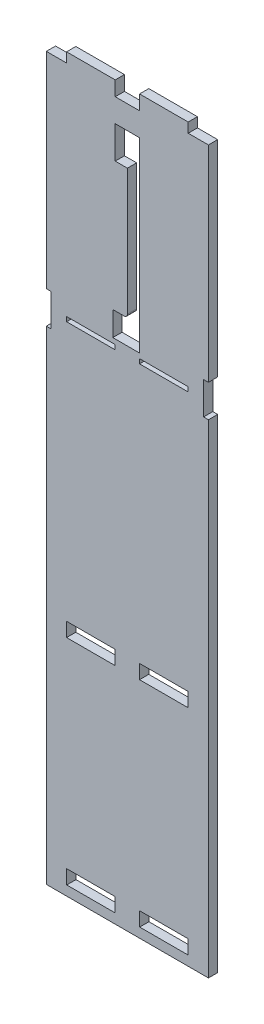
ISO-10303-21;
HEADER;
FILE_DESCRIPTION(('STEP AP214'),'2;1');
FILE_NAME('part.step','',(''),(''),'','','');
FILE_SCHEMA(('AUTOMOTIVE_DESIGN { 1 0 10303 214 1 1 1 1 }'));
ENDSEC;
DATA;
#1=APPLICATION_CONTEXT('core data for automotive mechanical design processes');
#2=APPLICATION_PROTOCOL_DEFINITION('international standard','automotive_design',2000,#1);
#3=PRODUCT_CONTEXT('',#1,'mechanical');
#4=PRODUCT('Part','Part','',(#3));
#5=PRODUCT_RELATED_PRODUCT_CATEGORY('part','',(#4));
#6=PRODUCT_DEFINITION_FORMATION('','',#4);
#7=PRODUCT_DEFINITION_CONTEXT('part definition',#1,'design');
#8=PRODUCT_DEFINITION('design','',#6,#7);
#9=PRODUCT_DEFINITION_SHAPE('','',#8);
#10=(LENGTH_UNIT() NAMED_UNIT(*) SI_UNIT(.MILLI.,.METRE.));
#11=(NAMED_UNIT(*) PLANE_ANGLE_UNIT() SI_UNIT($,.RADIAN.));
#12=(NAMED_UNIT(*) SI_UNIT($,.STERADIAN.) SOLID_ANGLE_UNIT());
#13=UNCERTAINTY_MEASURE_WITH_UNIT(LENGTH_MEASURE(1.E-05),#10,'distance_accuracy_value','');
#14=(GEOMETRIC_REPRESENTATION_CONTEXT(3) GLOBAL_UNCERTAINTY_ASSIGNED_CONTEXT((#13)) GLOBAL_UNIT_ASSIGNED_CONTEXT((#10,
#11,#12)) REPRESENTATION_CONTEXT('',''));
#15=CARTESIAN_POINT('',(0.,0.,0.));
#16=DIRECTION('',(0.,0.,1.));
#17=DIRECTION('',(1.,0.,0.));
#18=AXIS2_PLACEMENT_3D('',#15,#16,#17);
#19=CARTESIAN_POINT('',(50.,-222.5,5.7));
#20=DIRECTION('',(-1.,0.,0.));
#21=DIRECTION('',(0.,0.,1.));
#22=AXIS2_PLACEMENT_3D('',#19,#20,#21);
#23=PLANE('',#22);
#24=DIRECTION('',(0.,1.,0.));
#25=VECTOR('',#24,1.);
#26=CARTESIAN_POINT('',(50.,-222.5,5.7));
#27=LINE('',#26,#25);
#28=CARTESIAN_POINT('',(50.,95.6999999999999,5.7));
#29=VERTEX_POINT('',#28);
#30=CARTESIAN_POINT('',(50.,222.5,5.7));
#31=VERTEX_POINT('',#30);
#32=EDGE_CURVE('E741',#29,#31,#27,.T.);
#33=ORIENTED_EDGE('',*,*,#32,.F.);
#34=DIRECTION('',(0.,0.,1.));
#35=VECTOR('',#34,1.);
#36=CARTESIAN_POINT('',(50.,95.6999999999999,-0.00100000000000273));
#37=LINE('',#36,#35);
#38=CARTESIAN_POINT('',(50.,95.6999999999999,0.));
#39=VERTEX_POINT('',#38);
#40=EDGE_CURVE('E440',#39,#29,#37,.T.);
#41=ORIENTED_EDGE('',*,*,#40,.F.);
#42=DIRECTION('',(0.,1.,0.));
#43=VECTOR('',#42,1.);
#44=CARTESIAN_POINT('',(50.,-222.5,0.));
#45=LINE('',#44,#43);
#46=CARTESIAN_POINT('',(50.,222.5,0.));
#47=VERTEX_POINT('',#46);
#48=EDGE_CURVE('E736',#39,#47,#45,.T.);
#49=ORIENTED_EDGE('',*,*,#48,.T.);
#50=DIRECTION('',(0.,0.,-1.));
#51=VECTOR('',#50,1.);
#52=CARTESIAN_POINT('',(50.,222.5,5.7));
#53=LINE('',#52,#51);
#54=EDGE_CURVE('E772',#31,#47,#53,.T.);
#55=ORIENTED_EDGE('',*,*,#54,.F.);
#56=EDGE_LOOP('',(#33,#41,#49,#55));
#57=FACE_BOUND('',#56,.T.);
#58=ADVANCED_FACE('F35',(#57),#23,.F.);
#59=CARTESIAN_POINT('',(-50.,-222.5,5.7));
#60=DIRECTION('',(1.,0.,0.));
#61=DIRECTION('',(0.,0.,-1.));
#62=AXIS2_PLACEMENT_3D('',#59,#60,#61);
#63=PLANE('',#62);
#64=DIRECTION('',(0.,-1.,0.));
#65=VECTOR('',#64,1.);
#66=CARTESIAN_POINT('',(-50.,-222.5,5.7));
#67=LINE('',#66,#65);
#68=CARTESIAN_POINT('',(-50.,75.6999999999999,5.7));
#69=VERTEX_POINT('',#68);
#70=CARTESIAN_POINT('',(-50.,-222.5,5.7));
#71=VERTEX_POINT('',#70);
#72=EDGE_CURVE('E745',#69,#71,#67,.T.);
#73=ORIENTED_EDGE('',*,*,#72,.F.);
#74=DIRECTION('',(0.,0.,1.));
#75=VECTOR('',#74,1.);
#76=CARTESIAN_POINT('',(-50.,75.6999999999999,-0.00100000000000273));
#77=LINE('',#76,#75);
#78=CARTESIAN_POINT('',(-50.,75.6999999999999,0.));
#79=VERTEX_POINT('',#78);
#80=EDGE_CURVE('E414',#79,#69,#77,.T.);
#81=ORIENTED_EDGE('',*,*,#80,.F.);
#82=DIRECTION('',(0.,-1.,0.));
#83=VECTOR('',#82,1.);
#84=CARTESIAN_POINT('',(-50.,-222.5,0.));
#85=LINE('',#84,#83);
#86=CARTESIAN_POINT('',(-50.,-222.5,0.));
#87=VERTEX_POINT('',#86);
#88=EDGE_CURVE('E758',#79,#87,#85,.T.);
#89=ORIENTED_EDGE('',*,*,#88,.T.);
#90=DIRECTION('',(0.,0.,-1.));
#91=VECTOR('',#90,1.);
#92=CARTESIAN_POINT('',(-50.,-222.5,5.7));
#93=LINE('',#92,#91);
#94=EDGE_CURVE('E766',#71,#87,#93,.T.);
#95=ORIENTED_EDGE('',*,*,#94,.F.);
#96=EDGE_LOOP('',(#73,#81,#89,#95));
#97=FACE_BOUND('',#96,.T.);
#98=ADVANCED_FACE('F805',(#97),#63,.F.);
#99=CARTESIAN_POINT('',(-50.,222.5,5.7));
#100=DIRECTION('',(0.,-1.,0.));
#101=DIRECTION('',(0.,0.,-1.));
#102=AXIS2_PLACEMENT_3D('',#99,#100,#101);
#103=PLANE('',#102);
#104=DIRECTION('',(0.,0.,-1.));
#105=VECTOR('',#104,1.);
#106=CARTESIAN_POINT('',(37.5,222.5,0.));
#107=LINE('',#106,#105);
#108=CARTESIAN_POINT('',(37.5,222.5,5.7));
#109=VERTEX_POINT('',#108);
#110=CARTESIAN_POINT('',(37.5,222.5,0.));
#111=VERTEX_POINT('',#110);
#112=EDGE_CURVE('E692',#109,#111,#107,.T.);
#113=ORIENTED_EDGE('',*,*,#112,.F.);
#114=DIRECTION('',(-1.,0.,0.));
#115=VECTOR('',#114,1.);
#116=CARTESIAN_POINT('',(-50.,222.5,5.7));
#117=LINE('',#116,#115);
#118=EDGE_CURVE('E742',#31,#109,#117,.T.);
#119=ORIENTED_EDGE('',*,*,#118,.F.);
#120=ORIENTED_EDGE('',*,*,#54,.T.);
#121=DIRECTION('',(-1.,0.,0.));
#122=VECTOR('',#121,1.);
#123=CARTESIAN_POINT('',(-50.,222.5,0.));
#124=LINE('',#123,#122);
#125=EDGE_CURVE('E756',#47,#111,#124,.T.);
#126=ORIENTED_EDGE('',*,*,#125,.T.);
#127=EDGE_LOOP('',(#113,#119,#120,#126));
#128=FACE_BOUND('',#127,.T.);
#129=ADVANCED_FACE('F811',(#128),#103,.F.);
#130=DIRECTION('',(0.,0.,1.));
#131=VECTOR('',#130,1.);
#132=CARTESIAN_POINT('',(-37.5,222.5,0.));
#133=LINE('',#132,#131);
#134=CARTESIAN_POINT('',(-37.5,222.5,0.));
#135=VERTEX_POINT('',#134);
#136=CARTESIAN_POINT('',(-37.5,222.5,5.7));
#137=VERTEX_POINT('',#136);
#138=EDGE_CURVE('E714',#135,#137,#133,.T.);
#139=ORIENTED_EDGE('',*,*,#138,.F.);
#140=CARTESIAN_POINT('',(-50.,222.5,0.));
#141=VERTEX_POINT('',#140);
#142=EDGE_CURVE('E755',#135,#141,#124,.T.);
#143=ORIENTED_EDGE('',*,*,#142,.T.);
#144=DIRECTION('',(0.,0.,-1.));
#145=VECTOR('',#144,1.);
#146=CARTESIAN_POINT('',(-50.,222.5,5.7));
#147=LINE('',#146,#145);
#148=CARTESIAN_POINT('',(-50.,222.5,5.7));
#149=VERTEX_POINT('',#148);
#150=EDGE_CURVE('E769',#149,#141,#147,.T.);
#151=ORIENTED_EDGE('',*,*,#150,.F.);
#152=EDGE_CURVE('E740',#137,#149,#117,.T.);
#153=ORIENTED_EDGE('',*,*,#152,.F.);
#154=EDGE_LOOP('',(#139,#143,#151,#153));
#155=FACE_BOUND('',#154,.T.);
#156=ADVANCED_FACE('F818',(#155),#103,.F.);
#157=CARTESIAN_POINT('',(50.,-222.5,0.));
#158=VERTEX_POINT('',#157);
#159=CARTESIAN_POINT('',(50.,75.6999999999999,0.));
#160=VERTEX_POINT('',#159);
#161=EDGE_CURVE('E752',#158,#160,#45,.T.);
#162=ORIENTED_EDGE('',*,*,#161,.T.);
#163=DIRECTION('',(0.,0.,-1.));
#164=VECTOR('',#163,1.);
#165=CARTESIAN_POINT('',(50.,75.6999999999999,-0.00100000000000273));
#166=LINE('',#165,#164);
#167=CARTESIAN_POINT('',(50.,75.6999999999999,5.7));
#168=VERTEX_POINT('',#167);
#169=EDGE_CURVE('E438',#168,#160,#166,.T.);
#170=ORIENTED_EDGE('',*,*,#169,.F.);
#171=CARTESIAN_POINT('',(50.,-222.5,5.7));
#172=VERTEX_POINT('',#171);
#173=EDGE_CURVE('E737',#172,#168,#27,.T.);
#174=ORIENTED_EDGE('',*,*,#173,.F.);
#175=DIRECTION('',(0.,0.,-1.));
#176=VECTOR('',#175,1.);
#177=CARTESIAN_POINT('',(50.,-222.5,5.7));
#178=LINE('',#177,#176);
#179=EDGE_CURVE('E751',#172,#158,#178,.T.);
#180=ORIENTED_EDGE('',*,*,#179,.T.);
#181=EDGE_LOOP('',(#162,#170,#174,#180));
#182=FACE_BOUND('',#181,.T.);
#183=ADVANCED_FACE('F807',(#182),#23,.F.);
#184=CARTESIAN_POINT('',(-50.,95.6999999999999,0.));
#185=VERTEX_POINT('',#184);
#186=EDGE_CURVE('E759',#141,#185,#85,.T.);
#187=ORIENTED_EDGE('',*,*,#186,.T.);
#188=DIRECTION('',(0.,0.,-1.));
#189=VECTOR('',#188,1.);
#190=CARTESIAN_POINT('',(-50.,95.6999999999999,-0.00100000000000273));
#191=LINE('',#190,#189);
#192=CARTESIAN_POINT('',(-50.,95.6999999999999,5.7));
#193=VERTEX_POINT('',#192);
#194=EDGE_CURVE('E412',#193,#185,#191,.T.);
#195=ORIENTED_EDGE('',*,*,#194,.F.);
#196=EDGE_CURVE('E746',#149,#193,#67,.T.);
#197=ORIENTED_EDGE('',*,*,#196,.F.);
#198=ORIENTED_EDGE('',*,*,#150,.T.);
#199=EDGE_LOOP('',(#187,#195,#197,#198));
#200=FACE_BOUND('',#199,.T.);
#201=ADVANCED_FACE('F814',(#200),#63,.F.);
#202=CARTESIAN_POINT('',(-50.,-222.5,5.7));
#203=DIRECTION('',(0.,1.,0.));
#204=DIRECTION('',(0.,0.,1.));
#205=AXIS2_PLACEMENT_3D('',#202,#203,#204);
#206=PLANE('',#205);
#207=DIRECTION('',(1.,0.,0.));
#208=VECTOR('',#207,1.);
#209=CARTESIAN_POINT('',(-50.,-222.5,0.));
#210=LINE('',#209,#208);
#211=EDGE_CURVE('E762',#87,#158,#210,.T.);
#212=ORIENTED_EDGE('',*,*,#211,.T.);
#213=ORIENTED_EDGE('',*,*,#179,.F.);
#214=DIRECTION('',(1.,0.,0.));
#215=VECTOR('',#214,1.);
#216=CARTESIAN_POINT('',(-50.,-222.5,5.7));
#217=LINE('',#216,#215);
#218=EDGE_CURVE('E749',#71,#172,#217,.T.);
#219=ORIENTED_EDGE('',*,*,#218,.F.);
#220=ORIENTED_EDGE('',*,*,#94,.T.);
#221=EDGE_LOOP('',(#212,#213,#219,#220));
#222=FACE_BOUND('',#221,.T.);
#223=ADVANCED_FACE('F824',(#222),#206,.F.);
#224=CARTESIAN_POINT('',(0.,0.,5.7));
#225=DIRECTION('',(0.,0.,-1.));
#226=DIRECTION('',(-1.,0.,0.));
#227=AXIS2_PLACEMENT_3D('',#224,#225,#226);
#228=PLANE('',#227);
#229=DIRECTION('',(0.,-1.,0.));
#230=VECTOR('',#229,1.);
#231=CARTESIAN_POINT('',(-37.4999999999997,87.0999999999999,5.7));
#232=LINE('',#231,#230);
#233=CARTESIAN_POINT('',(-37.4999999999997,87.0999999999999,5.7));
#234=VERTEX_POINT('',#233);
#235=CARTESIAN_POINT('',(-37.4999999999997,84.2999999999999,5.7));
#236=VERTEX_POINT('',#235);
#237=EDGE_CURVE('E474',#234,#236,#232,.T.);
#238=ORIENTED_EDGE('',*,*,#237,.F.);
#239=DIRECTION('',(-1.,0.,0.));
#240=VECTOR('',#239,1.);
#241=CARTESIAN_POINT('',(-7.49999999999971,87.0999999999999,5.7));
#242=LINE('',#241,#240);
#243=CARTESIAN_POINT('',(-7.49999999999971,87.0999999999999,5.7));
#244=VERTEX_POINT('',#243);
#245=EDGE_CURVE('E472',#244,#234,#242,.T.);
#246=ORIENTED_EDGE('',*,*,#245,.F.);
#247=DIRECTION('',(0.,1.,0.));
#248=VECTOR('',#247,1.);
#249=CARTESIAN_POINT('',(-7.49999999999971,87.0999999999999,5.7));
#250=LINE('',#249,#248);
#251=CARTESIAN_POINT('',(-7.49999999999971,84.2999999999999,5.7));
#252=VERTEX_POINT('',#251);
#253=EDGE_CURVE('E480',#252,#244,#250,.T.);
#254=ORIENTED_EDGE('',*,*,#253,.F.);
#255=DIRECTION('',(1.,0.,0.));
#256=VECTOR('',#255,1.);
#257=CARTESIAN_POINT('',(-7.49999999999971,84.2999999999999,5.7));
#258=LINE('',#257,#256);
#259=EDGE_CURVE('E477',#236,#252,#258,.T.);
#260=ORIENTED_EDGE('',*,*,#259,.F.);
#261=EDGE_LOOP('',(#238,#246,#254,#260));
#262=FACE_BOUND('',#261,.T.);
#263=DIRECTION('',(0.,-1.,0.));
#264=VECTOR('',#263,1.);
#265=CARTESIAN_POINT('',(-37.5000000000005,-75.7000000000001,5.7));
#266=LINE('',#265,#264);
#267=CARTESIAN_POINT('',(-37.5000000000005,-75.7000000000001,5.7));
#268=VERTEX_POINT('',#267);
#269=CARTESIAN_POINT('',(-37.5000000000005,-84.4000000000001,5.7));
#270=VERTEX_POINT('',#269);
#271=EDGE_CURVE('E506',#268,#270,#266,.T.);
#272=ORIENTED_EDGE('',*,*,#271,.F.);
#273=DIRECTION('',(-1.,0.,0.));
#274=VECTOR('',#273,1.);
#275=CARTESIAN_POINT('',(-7.49999999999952,-75.7000000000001,5.7));
#276=LINE('',#275,#274);
#277=CARTESIAN_POINT('',(-7.49999999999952,-75.7000000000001,5.7));
#278=VERTEX_POINT('',#277);
#279=EDGE_CURVE('E504',#278,#268,#276,.T.);
#280=ORIENTED_EDGE('',*,*,#279,.F.);
#281=DIRECTION('',(0.,1.,0.));
#282=VECTOR('',#281,1.);
#283=CARTESIAN_POINT('',(-7.49999999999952,-75.7000000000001,5.7));
#284=LINE('',#283,#282);
#285=CARTESIAN_POINT('',(-7.49999999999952,-84.4000000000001,5.7));
#286=VERTEX_POINT('',#285);
#287=EDGE_CURVE('E512',#286,#278,#284,.T.);
#288=ORIENTED_EDGE('',*,*,#287,.F.);
#289=DIRECTION('',(1.,0.,0.));
#290=VECTOR('',#289,1.);
#291=CARTESIAN_POINT('',(-7.49999999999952,-84.4000000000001,5.7));
#292=LINE('',#291,#290);
#293=EDGE_CURVE('E509',#270,#286,#292,.T.);
#294=ORIENTED_EDGE('',*,*,#293,.F.);
#295=EDGE_LOOP('',(#272,#280,#288,#294));
#296=FACE_BOUND('',#295,.T.);
#297=DIRECTION('',(1.,0.,0.));
#298=VECTOR('',#297,1.);
#299=CARTESIAN_POINT('',(7.6,-216.5,5.7));
#300=LINE('',#299,#298);
#301=CARTESIAN_POINT('',(7.6,-216.5,5.7));
#302=VERTEX_POINT('',#301);
#303=CARTESIAN_POINT('',(37.4,-216.5,5.7));
#304=VERTEX_POINT('',#303);
#305=EDGE_CURVE('E396',#302,#304,#300,.T.);
#306=ORIENTED_EDGE('',*,*,#305,.F.);
#307=DIRECTION('',(0.,-1.,0.));
#308=VECTOR('',#307,1.);
#309=CARTESIAN_POINT('',(7.6,-207.8,5.7));
#310=LINE('',#309,#308);
#311=CARTESIAN_POINT('',(7.6,-207.8,5.7));
#312=VERTEX_POINT('',#311);
#313=EDGE_CURVE('E388',#312,#302,#310,.T.);
#314=ORIENTED_EDGE('',*,*,#313,.F.);
#315=DIRECTION('',(-1.,0.,0.));
#316=VECTOR('',#315,1.);
#317=CARTESIAN_POINT('',(7.6,-207.8,5.7));
#318=LINE('',#317,#316);
#319=CARTESIAN_POINT('',(37.4,-207.8,5.7));
#320=VERTEX_POINT('',#319);
#321=EDGE_CURVE('E389',#320,#312,#318,.T.);
#322=ORIENTED_EDGE('',*,*,#321,.F.);
#323=DIRECTION('',(0.,1.,0.));
#324=VECTOR('',#323,1.);
#325=CARTESIAN_POINT('',(37.4,-207.8,5.7));
#326=LINE('',#325,#324);
#327=EDGE_CURVE('E403',#304,#320,#326,.T.);
#328=ORIENTED_EDGE('',*,*,#327,.F.);
#329=EDGE_LOOP('',(#306,#314,#322,#328));
#330=FACE_BOUND('',#329,.T.);
#331=DIRECTION('',(1.,0.,0.));
#332=VECTOR('',#331,1.);
#333=CARTESIAN_POINT('',(-37.4,-216.5,5.7));
#334=LINE('',#333,#332);
#335=CARTESIAN_POINT('',(-37.4,-216.5,5.7));
#336=VERTEX_POINT('',#335);
#337=CARTESIAN_POINT('',(-7.59999999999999,-216.5,5.7));
#338=VERTEX_POINT('',#337);
#339=EDGE_CURVE('E602',#336,#338,#334,.T.);
#340=ORIENTED_EDGE('',*,*,#339,.F.);
#341=DIRECTION('',(0.,-1.,0.));
#342=VECTOR('',#341,1.);
#343=CARTESIAN_POINT('',(-37.4,-207.8,5.7));
#344=LINE('',#343,#342);
#345=CARTESIAN_POINT('',(-37.4,-207.8,5.7));
#346=VERTEX_POINT('',#345);
#347=EDGE_CURVE('E600',#346,#336,#344,.T.);
#348=ORIENTED_EDGE('',*,*,#347,.F.);
#349=DIRECTION('',(-1.,0.,0.));
#350=VECTOR('',#349,1.);
#351=CARTESIAN_POINT('',(-37.4,-207.8,5.7));
#352=LINE('',#351,#350);
#353=CARTESIAN_POINT('',(-7.6,-207.8,5.7));
#354=VERTEX_POINT('',#353);
#355=EDGE_CURVE('E608',#354,#346,#352,.T.);
#356=ORIENTED_EDGE('',*,*,#355,.F.);
#357=DIRECTION('',(0.,1.,0.));
#358=VECTOR('',#357,1.);
#359=CARTESIAN_POINT('',(-7.6,-207.8,5.7));
#360=LINE('',#359,#358);
#361=EDGE_CURVE('E605',#338,#354,#360,.T.);
#362=ORIENTED_EDGE('',*,*,#361,.F.);
#363=EDGE_LOOP('',(#340,#348,#356,#362));
#364=FACE_BOUND('',#363,.T.);
#365=DIRECTION('',(-1.,0.,0.));
#366=VECTOR('',#365,1.);
#367=CARTESIAN_POINT('',(0.,105.1,5.7));
#368=LINE('',#367,#366);
#369=CARTESIAN_POINT('',(-2.,105.1,5.7));
#370=VERTEX_POINT('',#369);
#371=CARTESIAN_POINT('',(-8.99999999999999,105.1,5.7));
#372=VERTEX_POINT('',#371);
#373=EDGE_CURVE('E647',#370,#372,#368,.T.);
#374=ORIENTED_EDGE('',*,*,#373,.F.);
#375=CARTESIAN_POINT('',(-2.,107.1,5.7));
#376=DIRECTION('',(0.,0.,-1.));
#377=DIRECTION('',(-1.,0.,0.));
#378=AXIS2_PLACEMENT_3D('',#375,#376,#377);
#379=CIRCLE('',#378,2.);
#380=CARTESIAN_POINT('',(0.,107.1,5.7));
#381=VERTEX_POINT('',#380);
#382=EDGE_CURVE('E57',#370,#381,#379,.F.);
#383=ORIENTED_EDGE('',*,*,#382,.T.);
#384=DIRECTION('',(0.,-1.,0.));
#385=VECTOR('',#384,1.);
#386=CARTESIAN_POINT('',(0.,185.1,5.7));
#387=LINE('',#386,#385);
#388=CARTESIAN_POINT('',(0.,185.1,5.7));
#389=VERTEX_POINT('',#388);
#390=EDGE_CURVE('E645',#389,#381,#387,.T.);
#391=ORIENTED_EDGE('',*,*,#390,.F.);
#392=DIRECTION('',(1.,0.,0.));
#393=VECTOR('',#392,1.);
#394=CARTESIAN_POINT('',(-7.5,185.1,5.7));
#395=LINE('',#394,#393);
#396=CARTESIAN_POINT('',(-7.5,185.1,5.7));
#397=VERTEX_POINT('',#396);
#398=EDGE_CURVE('E643',#397,#389,#395,.T.);
#399=ORIENTED_EDGE('',*,*,#398,.F.);
#400=DIRECTION('',(0.,-1.,0.));
#401=VECTOR('',#400,1.);
#402=CARTESIAN_POINT('',(-7.5,205.1,5.7));
#403=LINE('',#402,#401);
#404=CARTESIAN_POINT('',(-7.5,205.1,5.7));
#405=VERTEX_POINT('',#404);
#406=EDGE_CURVE('E661',#405,#397,#403,.T.);
#407=ORIENTED_EDGE('',*,*,#406,.F.);
#408=DIRECTION('',(-1.,0.,0.));
#409=VECTOR('',#408,1.);
#410=CARTESIAN_POINT('',(-7.5,205.1,5.7));
#411=LINE('',#410,#409);
#412=CARTESIAN_POINT('',(7.5,205.1,5.7));
#413=VERTEX_POINT('',#412);
#414=EDGE_CURVE('E658',#413,#405,#411,.T.);
#415=ORIENTED_EDGE('',*,*,#414,.F.);
#416=DIRECTION('',(0.,1.,0.));
#417=VECTOR('',#416,1.);
#418=CARTESIAN_POINT('',(7.5,205.1,5.7));
#419=LINE('',#418,#417);
#420=CARTESIAN_POINT('',(7.49999999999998,90.0999999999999,5.7));
#421=VERTEX_POINT('',#420);
#422=EDGE_CURVE('E655',#421,#413,#419,.T.);
#423=ORIENTED_EDGE('',*,*,#422,.F.);
#424=DIRECTION('',(1.,0.,0.));
#425=VECTOR('',#424,1.);
#426=CARTESIAN_POINT('',(0.,90.0999999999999,5.7));
#427=LINE('',#426,#425);
#428=CARTESIAN_POINT('',(-8.99999999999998,90.0999999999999,5.7));
#429=VERTEX_POINT('',#428);
#430=EDGE_CURVE('E652',#429,#421,#427,.T.);
#431=ORIENTED_EDGE('',*,*,#430,.F.);
#432=DIRECTION('',(0.,-1.,0.));
#433=VECTOR('',#432,1.);
#434=CARTESIAN_POINT('',(-8.99999999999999,105.1,5.7));
#435=LINE('',#434,#433);
#436=EDGE_CURVE('E649',#372,#429,#435,.T.);
#437=ORIENTED_EDGE('',*,*,#436,.F.);
#438=EDGE_LOOP('',(#374,#383,#391,#399,#407,#415,#423,#431,#437));
#439=FACE_BOUND('',#438,.T.);
#440=DIRECTION('',(1.,0.,0.));
#441=VECTOR('',#440,1.);
#442=CARTESIAN_POINT('',(7.49999999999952,-84.4000000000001,5.7));
#443=LINE('',#442,#441);
#444=CARTESIAN_POINT('',(7.49999999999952,-84.4000000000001,5.7));
#445=VERTEX_POINT('',#444);
#446=CARTESIAN_POINT('',(37.5000000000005,-84.4000000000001,5.7));
#447=VERTEX_POINT('',#446);
#448=EDGE_CURVE('E538',#445,#447,#443,.T.);
#449=ORIENTED_EDGE('',*,*,#448,.F.);
#450=DIRECTION('',(0.,-1.,0.));
#451=VECTOR('',#450,1.);
#452=CARTESIAN_POINT('',(7.49999999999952,-75.7000000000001,5.7));
#453=LINE('',#452,#451);
#454=CARTESIAN_POINT('',(7.49999999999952,-75.7000000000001,5.7));
#455=VERTEX_POINT('',#454);
#456=EDGE_CURVE('E536',#455,#445,#453,.T.);
#457=ORIENTED_EDGE('',*,*,#456,.F.);
#458=DIRECTION('',(-1.,0.,0.));
#459=VECTOR('',#458,1.);
#460=CARTESIAN_POINT('',(7.49999999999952,-75.7000000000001,5.7));
#461=LINE('',#460,#459);
#462=CARTESIAN_POINT('',(37.5000000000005,-75.7000000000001,5.7));
#463=VERTEX_POINT('',#462);
#464=EDGE_CURVE('E544',#463,#455,#461,.T.);
#465=ORIENTED_EDGE('',*,*,#464,.F.);
#466=DIRECTION('',(0.,1.,0.));
#467=VECTOR('',#466,1.);
#468=CARTESIAN_POINT('',(37.5000000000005,-75.7000000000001,5.7));
#469=LINE('',#468,#467);
#470=EDGE_CURVE('E541',#447,#463,#469,.T.);
#471=ORIENTED_EDGE('',*,*,#470,.F.);
#472=EDGE_LOOP('',(#449,#457,#465,#471));
#473=FACE_BOUND('',#472,.T.);
#474=DIRECTION('',(1.,0.,0.));
#475=VECTOR('',#474,1.);
#476=CARTESIAN_POINT('',(7.49999999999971,84.2999999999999,5.7));
#477=LINE('',#476,#475);
#478=CARTESIAN_POINT('',(7.49999999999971,84.2999999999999,5.7));
#479=VERTEX_POINT('',#478);
#480=CARTESIAN_POINT('',(37.4999999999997,84.2999999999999,5.7));
#481=VERTEX_POINT('',#480);
#482=EDGE_CURVE('E570',#479,#481,#477,.T.);
#483=ORIENTED_EDGE('',*,*,#482,.F.);
#484=DIRECTION('',(0.,-1.,0.));
#485=VECTOR('',#484,1.);
#486=CARTESIAN_POINT('',(7.49999999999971,87.0999999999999,5.7));
#487=LINE('',#486,#485);
#488=CARTESIAN_POINT('',(7.49999999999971,87.0999999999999,5.7));
#489=VERTEX_POINT('',#488);
#490=EDGE_CURVE('E568',#489,#479,#487,.T.);
#491=ORIENTED_EDGE('',*,*,#490,.F.);
#492=DIRECTION('',(-1.,0.,0.));
#493=VECTOR('',#492,1.);
#494=CARTESIAN_POINT('',(7.49999999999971,87.0999999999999,5.7));
#495=LINE('',#494,#493);
#496=CARTESIAN_POINT('',(37.4999999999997,87.0999999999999,5.7));
#497=VERTEX_POINT('',#496);
#498=EDGE_CURVE('E576',#497,#489,#495,.T.);
#499=ORIENTED_EDGE('',*,*,#498,.F.);
#500=DIRECTION('',(0.,1.,0.));
#501=VECTOR('',#500,1.);
#502=CARTESIAN_POINT('',(37.4999999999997,87.0999999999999,5.7));
#503=LINE('',#502,#501);
#504=EDGE_CURVE('E573',#481,#497,#503,.T.);
#505=ORIENTED_EDGE('',*,*,#504,.F.);
#506=EDGE_LOOP('',(#483,#491,#499,#505));
#507=FACE_BOUND('',#506,.T.);
#508=DIRECTION('',(0.,1.,0.));
#509=VECTOR('',#508,1.);
#510=CARTESIAN_POINT('',(-47.,75.6999999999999,5.7));
#511=LINE('',#510,#509);
#512=CARTESIAN_POINT('',(-47.,75.6999999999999,5.7));
#513=VERTEX_POINT('',#512);
#514=CARTESIAN_POINT('',(-47.,95.6999999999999,5.7));
#515=VERTEX_POINT('',#514);
#516=EDGE_CURVE('E423',#513,#515,#511,.T.);
#517=ORIENTED_EDGE('',*,*,#516,.F.);
#518=DIRECTION('',(1.,0.,0.));
#519=VECTOR('',#518,1.);
#520=CARTESIAN_POINT('',(-53.,75.6999999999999,5.7));
#521=LINE('',#520,#519);
#522=EDGE_CURVE('E428',#69,#513,#521,.T.);
#523=ORIENTED_EDGE('',*,*,#522,.F.);
#524=ORIENTED_EDGE('',*,*,#72,.T.);
#525=ORIENTED_EDGE('',*,*,#218,.T.);
#526=ORIENTED_EDGE('',*,*,#173,.T.);
#527=DIRECTION('',(1.,0.,0.));
#528=VECTOR('',#527,1.);
#529=CARTESIAN_POINT('',(53.,75.6999999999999,5.7));
#530=LINE('',#529,#528);
#531=CARTESIAN_POINT('',(47.,75.6999999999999,5.7));
#532=VERTEX_POINT('',#531);
#533=EDGE_CURVE('E451',#532,#168,#530,.T.);
#534=ORIENTED_EDGE('',*,*,#533,.F.);
#535=DIRECTION('',(0.,-1.,0.));
#536=VECTOR('',#535,1.);
#537=CARTESIAN_POINT('',(47.,75.6999999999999,5.7));
#538=LINE('',#537,#536);
#539=CARTESIAN_POINT('',(47.,95.6999999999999,5.7));
#540=VERTEX_POINT('',#539);
#541=EDGE_CURVE('E448',#540,#532,#538,.T.);
#542=ORIENTED_EDGE('',*,*,#541,.F.);
#543=DIRECTION('',(-1.,0.,0.));
#544=VECTOR('',#543,1.);
#545=CARTESIAN_POINT('',(53.,95.6999999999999,5.7));
#546=LINE('',#545,#544);
#547=EDGE_CURVE('E453',#29,#540,#546,.T.);
#548=ORIENTED_EDGE('',*,*,#547,.F.);
#549=ORIENTED_EDGE('',*,*,#32,.T.);
#550=ORIENTED_EDGE('',*,*,#118,.T.);
#551=DIRECTION('',(0.,-1.,0.));
#552=VECTOR('',#551,1.);
#553=CARTESIAN_POINT('',(37.5,228.5,5.7));
#554=LINE('',#553,#552);
#555=CARTESIAN_POINT('',(37.5,228.5,5.7));
#556=VERTEX_POINT('',#555);
#557=EDGE_CURVE('E709',#556,#109,#554,.T.);
#558=ORIENTED_EDGE('',*,*,#557,.F.);
#559=DIRECTION('',(1.,0.,0.));
#560=VECTOR('',#559,1.);
#561=CARTESIAN_POINT('',(7.5,228.5,5.7));
#562=LINE('',#561,#560);
#563=CARTESIAN_POINT('',(7.5,228.5,5.7));
#564=VERTEX_POINT('',#563);
#565=EDGE_CURVE('E696',#564,#556,#562,.T.);
#566=ORIENTED_EDGE('',*,*,#565,.F.);
#567=DIRECTION('',(0.,-1.,0.));
#568=VECTOR('',#567,1.);
#569=CARTESIAN_POINT('',(7.5,228.5,5.7));
#570=LINE('',#569,#568);
#571=CARTESIAN_POINT('',(7.5,219.5,5.7));
#572=VERTEX_POINT('',#571);
#573=EDGE_CURVE('E712',#564,#572,#570,.T.);
#574=ORIENTED_EDGE('',*,*,#573,.T.);
#575=DIRECTION('',(1.,0.,0.));
#576=VECTOR('',#575,1.);
#577=CARTESIAN_POINT('',(-7.5,219.5,5.7));
#578=LINE('',#577,#576);
#579=CARTESIAN_POINT('',(-7.5,219.5,5.7));
#580=VERTEX_POINT('',#579);
#581=EDGE_CURVE('E623',#580,#572,#578,.T.);
#582=ORIENTED_EDGE('',*,*,#581,.F.);
#583=DIRECTION('',(0.,-1.,0.));
#584=VECTOR('',#583,1.);
#585=CARTESIAN_POINT('',(-7.5,228.5,5.7));
#586=LINE('',#585,#584);
#587=CARTESIAN_POINT('',(-7.5,228.5,5.7));
#588=VERTEX_POINT('',#587);
#589=EDGE_CURVE('E731',#588,#580,#586,.T.);
#590=ORIENTED_EDGE('',*,*,#589,.F.);
#591=DIRECTION('',(1.,0.,0.));
#592=VECTOR('',#591,1.);
#593=CARTESIAN_POINT('',(-37.5,228.5,5.7));
#594=LINE('',#593,#592);
#595=CARTESIAN_POINT('',(-37.5,228.5,5.7));
#596=VERTEX_POINT('',#595);
#597=EDGE_CURVE('E718',#596,#588,#594,.T.);
#598=ORIENTED_EDGE('',*,*,#597,.F.);
#599=DIRECTION('',(0.,-1.,0.));
#600=VECTOR('',#599,1.);
#601=CARTESIAN_POINT('',(-37.5,228.5,5.7));
#602=LINE('',#601,#600);
#603=EDGE_CURVE('E733',#596,#137,#602,.T.);
#604=ORIENTED_EDGE('',*,*,#603,.T.);
#605=ORIENTED_EDGE('',*,*,#152,.T.);
#606=ORIENTED_EDGE('',*,*,#196,.T.);
#607=DIRECTION('',(-1.,0.,0.));
#608=VECTOR('',#607,1.);
#609=CARTESIAN_POINT('',(-53.,95.6999999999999,5.7));
#610=LINE('',#609,#608);
#611=EDGE_CURVE('E426',#515,#193,#610,.T.);
#612=ORIENTED_EDGE('',*,*,#611,.F.);
#613=EDGE_LOOP('',(#517,#523,#524,#525,#526,#534,#542,#548,#549,#550,#558,#566,#574,#582,#590,
#598,#604,#605,#606,#612));
#614=FACE_BOUND('',#613,.T.);
#615=ADVANCED_FACE('F786',(#262,#296,#330,#364,#439,#473,#507,#614),#228,.F.);
#616=CARTESIAN_POINT('',(0.,0.,0.));
#617=DIRECTION('',(0.,0.,-1.));
#618=DIRECTION('',(-1.,0.,0.));
#619=AXIS2_PLACEMENT_3D('',#616,#617,#618);
#620=PLANE('',#619);
#621=DIRECTION('',(-1.,0.,0.));
#622=VECTOR('',#621,1.);
#623=CARTESIAN_POINT('',(-7.49999999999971,87.0999999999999,0.));
#624=LINE('',#623,#622);
#625=CARTESIAN_POINT('',(-7.49999999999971,87.0999999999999,0.));
#626=VERTEX_POINT('',#625);
#627=CARTESIAN_POINT('',(-37.4999999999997,87.0999999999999,0.));
#628=VERTEX_POINT('',#627);
#629=EDGE_CURVE('E469',#626,#628,#624,.T.);
#630=ORIENTED_EDGE('',*,*,#629,.T.);
#631=DIRECTION('',(0.,-1.,0.));
#632=VECTOR('',#631,1.);
#633=CARTESIAN_POINT('',(-37.4999999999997,87.0999999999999,0.));
#634=LINE('',#633,#632);
#635=CARTESIAN_POINT('',(-37.4999999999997,84.2999999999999,0.));
#636=VERTEX_POINT('',#635);
#637=EDGE_CURVE('E486',#628,#636,#634,.T.);
#638=ORIENTED_EDGE('',*,*,#637,.T.);
#639=DIRECTION('',(1.,0.,0.));
#640=VECTOR('',#639,1.);
#641=CARTESIAN_POINT('',(-7.49999999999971,84.2999999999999,0.));
#642=LINE('',#641,#640);
#643=CARTESIAN_POINT('',(-7.49999999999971,84.2999999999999,0.));
#644=VERTEX_POINT('',#643);
#645=EDGE_CURVE('E462',#636,#644,#642,.T.);
#646=ORIENTED_EDGE('',*,*,#645,.T.);
#647=DIRECTION('',(0.,1.,0.));
#648=VECTOR('',#647,1.);
#649=CARTESIAN_POINT('',(-7.49999999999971,87.0999999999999,0.));
#650=LINE('',#649,#648);
#651=EDGE_CURVE('E465',#644,#626,#650,.T.);
#652=ORIENTED_EDGE('',*,*,#651,.T.);
#653=EDGE_LOOP('',(#630,#638,#646,#652));
#654=FACE_BOUND('',#653,.T.);
#655=DIRECTION('',(-1.,0.,0.));
#656=VECTOR('',#655,1.);
#657=CARTESIAN_POINT('',(-7.49999999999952,-75.7000000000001,0.));
#658=LINE('',#657,#656);
#659=CARTESIAN_POINT('',(-7.49999999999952,-75.7000000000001,0.));
#660=VERTEX_POINT('',#659);
#661=CARTESIAN_POINT('',(-37.5000000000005,-75.7000000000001,0.));
#662=VERTEX_POINT('',#661);
#663=EDGE_CURVE('E501',#660,#662,#658,.T.);
#664=ORIENTED_EDGE('',*,*,#663,.T.);
#665=DIRECTION('',(0.,-1.,0.));
#666=VECTOR('',#665,1.);
#667=CARTESIAN_POINT('',(-37.5000000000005,-75.7000000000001,0.));
#668=LINE('',#667,#666);
#669=CARTESIAN_POINT('',(-37.5000000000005,-84.4000000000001,0.));
#670=VERTEX_POINT('',#669);
#671=EDGE_CURVE('E466',#662,#670,#668,.T.);
#672=ORIENTED_EDGE('',*,*,#671,.T.);
#673=DIRECTION('',(1.,0.,0.));
#674=VECTOR('',#673,1.);
#675=CARTESIAN_POINT('',(-7.49999999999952,-84.4000000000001,0.));
#676=LINE('',#675,#674);
#677=CARTESIAN_POINT('',(-7.49999999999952,-84.4000000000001,0.));
#678=VERTEX_POINT('',#677);
#679=EDGE_CURVE('E380',#670,#678,#676,.T.);
#680=ORIENTED_EDGE('',*,*,#679,.T.);
#681=DIRECTION('',(0.,1.,0.));
#682=VECTOR('',#681,1.);
#683=CARTESIAN_POINT('',(-7.49999999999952,-75.7000000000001,0.));
#684=LINE('',#683,#682);
#685=EDGE_CURVE('E498',#678,#660,#684,.T.);
#686=ORIENTED_EDGE('',*,*,#685,.T.);
#687=EDGE_LOOP('',(#664,#672,#680,#686));
#688=FACE_BOUND('',#687,.T.);
#689=DIRECTION('',(0.,-1.,0.));
#690=VECTOR('',#689,1.);
#691=CARTESIAN_POINT('',(7.6,-207.8,0.));
#692=LINE('',#691,#690);
#693=CARTESIAN_POINT('',(7.6,-207.8,0.));
#694=VERTEX_POINT('',#693);
#695=CARTESIAN_POINT('',(7.6,-216.5,0.));
#696=VERTEX_POINT('',#695);
#697=EDGE_CURVE('E385',#694,#696,#692,.T.);
#698=ORIENTED_EDGE('',*,*,#697,.T.);
#699=DIRECTION('',(1.,0.,0.));
#700=VECTOR('',#699,1.);
#701=CARTESIAN_POINT('',(7.6,-216.5,0.));
#702=LINE('',#701,#700);
#703=CARTESIAN_POINT('',(37.4,-216.5,0.));
#704=VERTEX_POINT('',#703);
#705=EDGE_CURVE('E369',#696,#704,#702,.T.);
#706=ORIENTED_EDGE('',*,*,#705,.T.);
#707=DIRECTION('',(0.,1.,0.));
#708=VECTOR('',#707,1.);
#709=CARTESIAN_POINT('',(37.4,-207.8,0.));
#710=LINE('',#709,#708);
#711=CARTESIAN_POINT('',(37.4,-207.8,0.));
#712=VERTEX_POINT('',#711);
#713=EDGE_CURVE('E398',#704,#712,#710,.T.);
#714=ORIENTED_EDGE('',*,*,#713,.T.);
#715=DIRECTION('',(-1.,0.,0.));
#716=VECTOR('',#715,1.);
#717=CARTESIAN_POINT('',(7.6,-207.8,0.));
#718=LINE('',#717,#716);
#719=EDGE_CURVE('E394',#712,#694,#718,.T.);
#720=ORIENTED_EDGE('',*,*,#719,.T.);
#721=EDGE_LOOP('',(#698,#706,#714,#720));
#722=FACE_BOUND('',#721,.T.);
#723=DIRECTION('',(1.,0.,0.));
#724=VECTOR('',#723,1.);
#725=CARTESIAN_POINT('',(-53.,75.6999999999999,0.));
#726=LINE('',#725,#724);
#727=CARTESIAN_POINT('',(-47.,75.6999999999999,0.));
#728=VERTEX_POINT('',#727);
#729=EDGE_CURVE('E420',#79,#728,#726,.T.);
#730=ORIENTED_EDGE('',*,*,#729,.T.);
#731=DIRECTION('',(0.,1.,0.));
#732=VECTOR('',#731,1.);
#733=CARTESIAN_POINT('',(-47.,75.6999999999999,0.));
#734=LINE('',#733,#732);
#735=CARTESIAN_POINT('',(-47.,95.6999999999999,0.));
#736=VERTEX_POINT('',#735);
#737=EDGE_CURVE('E417',#728,#736,#734,.T.);
#738=ORIENTED_EDGE('',*,*,#737,.T.);
#739=DIRECTION('',(-1.,0.,0.));
#740=VECTOR('',#739,1.);
#741=CARTESIAN_POINT('',(-53.,95.6999999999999,0.));
#742=LINE('',#741,#740);
#743=EDGE_CURVE('E434',#736,#185,#742,.T.);
#744=ORIENTED_EDGE('',*,*,#743,.T.);
#745=ORIENTED_EDGE('',*,*,#186,.F.);
#746=ORIENTED_EDGE('',*,*,#142,.F.);
#747=DIRECTION('',(0.,-1.,0.));
#748=VECTOR('',#747,1.);
#749=CARTESIAN_POINT('',(-37.5,228.5,0.));
#750=LINE('',#749,#748);
#751=CARTESIAN_POINT('',(-37.5,228.5,0.));
#752=VERTEX_POINT('',#751);
#753=EDGE_CURVE('E724',#752,#135,#750,.T.);
#754=ORIENTED_EDGE('',*,*,#753,.F.);
#755=DIRECTION('',(-1.,0.,0.));
#756=VECTOR('',#755,1.);
#757=CARTESIAN_POINT('',(-37.5,228.5,0.));
#758=LINE('',#757,#756);
#759=CARTESIAN_POINT('',(-7.5,228.5,0.));
#760=VERTEX_POINT('',#759);
#761=EDGE_CURVE('E722',#760,#752,#758,.T.);
#762=ORIENTED_EDGE('',*,*,#761,.F.);
#763=DIRECTION('',(0.,-1.,0.));
#764=VECTOR('',#763,1.);
#765=CARTESIAN_POINT('',(-7.5,228.5,0.));
#766=LINE('',#765,#764);
#767=CARTESIAN_POINT('',(-7.5,219.5,0.));
#768=VERTEX_POINT('',#767);
#769=EDGE_CURVE('E729',#760,#768,#766,.T.);
#770=ORIENTED_EDGE('',*,*,#769,.T.);
#771=DIRECTION('',(1.,0.,0.));
#772=VECTOR('',#771,1.);
#773=CARTESIAN_POINT('',(-7.5,219.5,0.));
#774=LINE('',#773,#772);
#775=CARTESIAN_POINT('',(7.5,219.5,0.));
#776=VERTEX_POINT('',#775);
#777=EDGE_CURVE('E687',#768,#776,#774,.T.);
#778=ORIENTED_EDGE('',*,*,#777,.T.);
#779=DIRECTION('',(0.,-1.,0.));
#780=VECTOR('',#779,1.);
#781=CARTESIAN_POINT('',(7.5,228.5,0.));
#782=LINE('',#781,#780);
#783=CARTESIAN_POINT('',(7.5,228.5,0.));
#784=VERTEX_POINT('',#783);
#785=EDGE_CURVE('E702',#784,#776,#782,.T.);
#786=ORIENTED_EDGE('',*,*,#785,.F.);
#787=DIRECTION('',(-1.,0.,0.));
#788=VECTOR('',#787,1.);
#789=CARTESIAN_POINT('',(7.5,228.5,0.));
#790=LINE('',#789,#788);
#791=CARTESIAN_POINT('',(37.5,228.5,0.));
#792=VERTEX_POINT('',#791);
#793=EDGE_CURVE('E700',#792,#784,#790,.T.);
#794=ORIENTED_EDGE('',*,*,#793,.F.);
#795=DIRECTION('',(0.,-1.,0.));
#796=VECTOR('',#795,1.);
#797=CARTESIAN_POINT('',(37.5,228.5,0.));
#798=LINE('',#797,#796);
#799=EDGE_CURVE('E706',#792,#111,#798,.T.);
#800=ORIENTED_EDGE('',*,*,#799,.T.);
#801=ORIENTED_EDGE('',*,*,#125,.F.);
#802=ORIENTED_EDGE('',*,*,#48,.F.);
#803=DIRECTION('',(-1.,0.,0.));
#804=VECTOR('',#803,1.);
#805=CARTESIAN_POINT('',(53.,95.6999999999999,0.));
#806=LINE('',#805,#804);
#807=CARTESIAN_POINT('',(47.,95.6999999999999,0.));
#808=VERTEX_POINT('',#807);
#809=EDGE_CURVE('E445',#39,#808,#806,.T.);
#810=ORIENTED_EDGE('',*,*,#809,.T.);
#811=DIRECTION('',(0.,-1.,0.));
#812=VECTOR('',#811,1.);
#813=CARTESIAN_POINT('',(47.,75.6999999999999,0.));
#814=LINE('',#813,#812);
#815=CARTESIAN_POINT('',(47.,75.6999999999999,0.));
#816=VERTEX_POINT('',#815);
#817=EDGE_CURVE('E442',#808,#816,#814,.T.);
#818=ORIENTED_EDGE('',*,*,#817,.T.);
#819=DIRECTION('',(1.,0.,0.));
#820=VECTOR('',#819,1.);
#821=CARTESIAN_POINT('',(53.,75.6999999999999,0.));
#822=LINE('',#821,#820);
#823=EDGE_CURVE('E415',#816,#160,#822,.T.);
#824=ORIENTED_EDGE('',*,*,#823,.T.);
#825=ORIENTED_EDGE('',*,*,#161,.F.);
#826=ORIENTED_EDGE('',*,*,#211,.F.);
#827=ORIENTED_EDGE('',*,*,#88,.F.);
#828=EDGE_LOOP('',(#730,#738,#744,#745,#746,#754,#762,#770,#778,#786,#794,#800,#801,#802,#810,
#818,#824,#825,#826,#827));
#829=FACE_BOUND('',#828,.T.);
#830=DIRECTION('',(0.,-1.,0.));
#831=VECTOR('',#830,1.);
#832=CARTESIAN_POINT('',(-37.4,-207.8,0.));
#833=LINE('',#832,#831);
#834=CARTESIAN_POINT('',(-37.4,-207.8,0.));
#835=VERTEX_POINT('',#834);
#836=CARTESIAN_POINT('',(-37.4,-216.5,0.));
#837=VERTEX_POINT('',#836);
#838=EDGE_CURVE('E597',#835,#837,#833,.T.);
#839=ORIENTED_EDGE('',*,*,#838,.T.);
#840=DIRECTION('',(1.,0.,0.));
#841=VECTOR('',#840,1.);
#842=CARTESIAN_POINT('',(-37.4,-216.5,0.));
#843=LINE('',#842,#841);
#844=CARTESIAN_POINT('',(-7.59999999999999,-216.5,0.));
#845=VERTEX_POINT('',#844);
#846=EDGE_CURVE('E614',#837,#845,#843,.T.);
#847=ORIENTED_EDGE('',*,*,#846,.T.);
#848=DIRECTION('',(0.,1.,0.));
#849=VECTOR('',#848,1.);
#850=CARTESIAN_POINT('',(-7.6,-207.8,0.));
#851=LINE('',#850,#849);
#852=CARTESIAN_POINT('',(-7.6,-207.8,0.));
#853=VERTEX_POINT('',#852);
#854=EDGE_CURVE('E590',#845,#853,#851,.T.);
#855=ORIENTED_EDGE('',*,*,#854,.T.);
#856=DIRECTION('',(-1.,0.,0.));
#857=VECTOR('',#856,1.);
#858=CARTESIAN_POINT('',(-37.4,-207.8,0.));
#859=LINE('',#858,#857);
#860=EDGE_CURVE('E593',#853,#835,#859,.T.);
#861=ORIENTED_EDGE('',*,*,#860,.T.);
#862=EDGE_LOOP('',(#839,#847,#855,#861));
#863=FACE_BOUND('',#862,.T.);
#864=DIRECTION('',(0.,-1.,0.));
#865=VECTOR('',#864,1.);
#866=CARTESIAN_POINT('',(0.,185.1,0.));
#867=LINE('',#866,#865);
#868=CARTESIAN_POINT('',(0.,185.1,0.));
#869=VERTEX_POINT('',#868);
#870=CARTESIAN_POINT('',(0.,107.1,0.));
#871=VERTEX_POINT('',#870);
#872=EDGE_CURVE('E594',#869,#871,#867,.T.);
#873=ORIENTED_EDGE('',*,*,#872,.T.);
#874=CARTESIAN_POINT('',(-2.,107.1,0.));
#875=DIRECTION('',(0.,0.,-1.));
#876=DIRECTION('',(-1.,0.,0.));
#877=AXIS2_PLACEMENT_3D('',#874,#875,#876);
#878=CIRCLE('',#877,2.);
#879=CARTESIAN_POINT('',(-2.,105.1,0.));
#880=VERTEX_POINT('',#879);
#881=EDGE_CURVE('E11',#871,#880,#878,.T.);
#882=ORIENTED_EDGE('',*,*,#881,.T.);
#883=DIRECTION('',(-1.,0.,0.));
#884=VECTOR('',#883,1.);
#885=CARTESIAN_POINT('',(0.,105.1,0.));
#886=LINE('',#885,#884);
#887=CARTESIAN_POINT('',(-8.99999999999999,105.1,0.));
#888=VERTEX_POINT('',#887);
#889=EDGE_CURVE('E559',#880,#888,#886,.T.);
#890=ORIENTED_EDGE('',*,*,#889,.T.);
#891=DIRECTION('',(0.,-1.,0.));
#892=VECTOR('',#891,1.);
#893=CARTESIAN_POINT('',(-8.99999999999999,105.1,0.));
#894=LINE('',#893,#892);
#895=CARTESIAN_POINT('',(-8.99999999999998,90.0999999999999,0.));
#896=VERTEX_POINT('',#895);
#897=EDGE_CURVE('E625',#888,#896,#894,.T.);
#898=ORIENTED_EDGE('',*,*,#897,.T.);
#899=DIRECTION('',(1.,0.,0.));
#900=VECTOR('',#899,1.);
#901=CARTESIAN_POINT('',(0.,90.0999999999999,0.));
#902=LINE('',#901,#900);
#903=CARTESIAN_POINT('',(7.49999999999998,90.0999999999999,0.));
#904=VERTEX_POINT('',#903);
#905=EDGE_CURVE('E628',#896,#904,#902,.T.);
#906=ORIENTED_EDGE('',*,*,#905,.T.);
#907=DIRECTION('',(0.,1.,0.));
#908=VECTOR('',#907,1.);
#909=CARTESIAN_POINT('',(7.5,205.1,0.));
#910=LINE('',#909,#908);
#911=CARTESIAN_POINT('',(7.5,205.1,0.));
#912=VERTEX_POINT('',#911);
#913=EDGE_CURVE('E631',#904,#912,#910,.T.);
#914=ORIENTED_EDGE('',*,*,#913,.T.);
#915=DIRECTION('',(-1.,0.,0.));
#916=VECTOR('',#915,1.);
#917=CARTESIAN_POINT('',(-7.5,205.1,0.));
#918=LINE('',#917,#916);
#919=CARTESIAN_POINT('',(-7.5,205.1,0.));
#920=VERTEX_POINT('',#919);
#921=EDGE_CURVE('E634',#912,#920,#918,.T.);
#922=ORIENTED_EDGE('',*,*,#921,.T.);
#923=DIRECTION('',(0.,-1.,0.));
#924=VECTOR('',#923,1.);
#925=CARTESIAN_POINT('',(-7.5,205.1,0.));
#926=LINE('',#925,#924);
#927=CARTESIAN_POINT('',(-7.5,185.1,0.));
#928=VERTEX_POINT('',#927);
#929=EDGE_CURVE('E637',#920,#928,#926,.T.);
#930=ORIENTED_EDGE('',*,*,#929,.T.);
#931=DIRECTION('',(1.,0.,0.));
#932=VECTOR('',#931,1.);
#933=CARTESIAN_POINT('',(-7.5,185.1,0.));
#934=LINE('',#933,#932);
#935=EDGE_CURVE('E640',#928,#869,#934,.T.);
#936=ORIENTED_EDGE('',*,*,#935,.T.);
#937=EDGE_LOOP('',(#873,#882,#890,#898,#906,#914,#922,#930,#936));
#938=FACE_BOUND('',#937,.T.);
#939=DIRECTION('',(0.,-1.,0.));
#940=VECTOR('',#939,1.);
#941=CARTESIAN_POINT('',(7.49999999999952,-75.7000000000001,0.));
#942=LINE('',#941,#940);
#943=CARTESIAN_POINT('',(7.49999999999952,-75.7000000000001,0.));
#944=VERTEX_POINT('',#943);
#945=CARTESIAN_POINT('',(7.49999999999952,-84.4000000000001,0.));
#946=VERTEX_POINT('',#945);
#947=EDGE_CURVE('E533',#944,#946,#942,.T.);
#948=ORIENTED_EDGE('',*,*,#947,.T.);
#949=DIRECTION('',(1.,0.,0.));
#950=VECTOR('',#949,1.);
#951=CARTESIAN_POINT('',(7.49999999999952,-84.4000000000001,0.));
#952=LINE('',#951,#950);
#953=CARTESIAN_POINT('',(37.5000000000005,-84.4000000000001,0.));
#954=VERTEX_POINT('',#953);
#955=EDGE_CURVE('E550',#946,#954,#952,.T.);
#956=ORIENTED_EDGE('',*,*,#955,.T.);
#957=DIRECTION('',(0.,1.,0.));
#958=VECTOR('',#957,1.);
#959=CARTESIAN_POINT('',(37.5000000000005,-75.7000000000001,0.));
#960=LINE('',#959,#958);
#961=CARTESIAN_POINT('',(37.5000000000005,-75.7000000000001,0.));
#962=VERTEX_POINT('',#961);
#963=EDGE_CURVE('E526',#954,#962,#960,.T.);
#964=ORIENTED_EDGE('',*,*,#963,.T.);
#965=DIRECTION('',(-1.,0.,0.));
#966=VECTOR('',#965,1.);
#967=CARTESIAN_POINT('',(7.49999999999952,-75.7000000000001,0.));
#968=LINE('',#967,#966);
#969=EDGE_CURVE('E529',#962,#944,#968,.T.);
#970=ORIENTED_EDGE('',*,*,#969,.T.);
#971=EDGE_LOOP('',(#948,#956,#964,#970));
#972=FACE_BOUND('',#971,.T.);
#973=DIRECTION('',(0.,-1.,0.));
#974=VECTOR('',#973,1.);
#975=CARTESIAN_POINT('',(7.49999999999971,87.0999999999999,0.));
#976=LINE('',#975,#974);
#977=CARTESIAN_POINT('',(7.49999999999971,87.0999999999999,0.));
#978=VERTEX_POINT('',#977);
#979=CARTESIAN_POINT('',(7.49999999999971,84.2999999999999,0.));
#980=VERTEX_POINT('',#979);
#981=EDGE_CURVE('E565',#978,#980,#976,.T.);
#982=ORIENTED_EDGE('',*,*,#981,.T.);
#983=DIRECTION('',(1.,0.,0.));
#984=VECTOR('',#983,1.);
#985=CARTESIAN_POINT('',(7.49999999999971,84.2999999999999,0.));
#986=LINE('',#985,#984);
#987=CARTESIAN_POINT('',(37.4999999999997,84.2999999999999,0.));
#988=VERTEX_POINT('',#987);
#989=EDGE_CURVE('E530',#980,#988,#986,.T.);
#990=ORIENTED_EDGE('',*,*,#989,.T.);
#991=DIRECTION('',(0.,1.,0.));
#992=VECTOR('',#991,1.);
#993=CARTESIAN_POINT('',(37.4999999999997,87.0999999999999,0.));
#994=LINE('',#993,#992);
#995=CARTESIAN_POINT('',(37.4999999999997,87.0999999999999,0.));
#996=VERTEX_POINT('',#995);
#997=EDGE_CURVE('E495',#988,#996,#994,.T.);
#998=ORIENTED_EDGE('',*,*,#997,.T.);
#999=DIRECTION('',(-1.,0.,0.));
#1000=VECTOR('',#999,1.);
#1001=CARTESIAN_POINT('',(7.49999999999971,87.0999999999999,0.));
#1002=LINE('',#1001,#1000);
#1003=EDGE_CURVE('E562',#996,#978,#1002,.T.);
#1004=ORIENTED_EDGE('',*,*,#1003,.T.);
#1005=EDGE_LOOP('',(#982,#990,#998,#1004));
#1006=FACE_BOUND('',#1005,.T.);
#1007=ADVANCED_FACE('F392',(#654,#688,#722,#829,#863,#938,#972,#1006),#620,.T.);
#1008=CARTESIAN_POINT('',(-37.5,228.5,0.));
#1009=DIRECTION('',(1.,0.,0.));
#1010=DIRECTION('',(0.,0.,-1.));
#1011=AXIS2_PLACEMENT_3D('',#1008,#1009,#1010);
#1012=PLANE('',#1011);
#1013=ORIENTED_EDGE('',*,*,#138,.T.);
#1014=ORIENTED_EDGE('',*,*,#603,.F.);
#1015=DIRECTION('',(0.,0.,1.));
#1016=VECTOR('',#1015,1.);
#1017=CARTESIAN_POINT('',(-37.5,228.5,0.));
#1018=LINE('',#1017,#1016);
#1019=EDGE_CURVE('E715',#752,#596,#1018,.T.);
#1020=ORIENTED_EDGE('',*,*,#1019,.F.);
#1021=ORIENTED_EDGE('',*,*,#753,.T.);
#1022=EDGE_LOOP('',(#1013,#1014,#1020,#1021));
#1023=FACE_BOUND('',#1022,.T.);
#1024=ADVANCED_FACE('F869',(#1023),#1012,.F.);
#1025=CARTESIAN_POINT('',(-7.5,228.5,0.));
#1026=DIRECTION('',(-1.,0.,0.));
#1027=DIRECTION('',(0.,0.,1.));
#1028=AXIS2_PLACEMENT_3D('',#1025,#1026,#1027);
#1029=PLANE('',#1028);
#1030=ORIENTED_EDGE('',*,*,#589,.T.);
#1031=DIRECTION('',(0.,0.,1.));
#1032=VECTOR('',#1031,1.);
#1033=CARTESIAN_POINT('',(-7.5,219.5,-0.00100000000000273));
#1034=LINE('',#1033,#1032);
#1035=EDGE_CURVE('E683',#768,#580,#1034,.T.);
#1036=ORIENTED_EDGE('',*,*,#1035,.F.);
#1037=ORIENTED_EDGE('',*,*,#769,.F.);
#1038=DIRECTION('',(0.,0.,-1.));
#1039=VECTOR('',#1038,1.);
#1040=CARTESIAN_POINT('',(-7.5,228.5,0.));
#1041=LINE('',#1040,#1039);
#1042=EDGE_CURVE('E720',#588,#760,#1041,.T.);
#1043=ORIENTED_EDGE('',*,*,#1042,.F.);
#1044=EDGE_LOOP('',(#1030,#1036,#1037,#1043));
#1045=FACE_BOUND('',#1044,.T.);
#1046=ADVANCED_FACE('F884',(#1045),#1029,.F.);
#1047=CARTESIAN_POINT('',(0.,228.5,0.));
#1048=DIRECTION('',(0.,1.,0.));
#1049=DIRECTION('',(0.,0.,1.));
#1050=AXIS2_PLACEMENT_3D('',#1047,#1048,#1049);
#1051=PLANE('',#1050);
#1052=ORIENTED_EDGE('',*,*,#1019,.T.);
#1053=ORIENTED_EDGE('',*,*,#597,.T.);
#1054=ORIENTED_EDGE('',*,*,#1042,.T.);
#1055=ORIENTED_EDGE('',*,*,#761,.T.);
#1056=EDGE_LOOP('',(#1052,#1053,#1054,#1055));
#1057=FACE_BOUND('',#1056,.T.);
#1058=ADVANCED_FACE('F872',(#1057),#1051,.T.);
#1059=CARTESIAN_POINT('',(7.5,228.5,0.));
#1060=DIRECTION('',(1.,0.,0.));
#1061=DIRECTION('',(0.,0.,-1.));
#1062=AXIS2_PLACEMENT_3D('',#1059,#1060,#1061);
#1063=PLANE('',#1062);
#1064=ORIENTED_EDGE('',*,*,#785,.T.);
#1065=DIRECTION('',(0.,0.,1.));
#1066=VECTOR('',#1065,1.);
#1067=CARTESIAN_POINT('',(7.5,219.5,-0.00100000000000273));
#1068=LINE('',#1067,#1066);
#1069=EDGE_CURVE('E684',#776,#572,#1068,.T.);
#1070=ORIENTED_EDGE('',*,*,#1069,.T.);
#1071=ORIENTED_EDGE('',*,*,#573,.F.);
#1072=DIRECTION('',(0.,0.,1.));
#1073=VECTOR('',#1072,1.);
#1074=CARTESIAN_POINT('',(7.5,228.5,0.));
#1075=LINE('',#1074,#1073);
#1076=EDGE_CURVE('E693',#784,#564,#1075,.T.);
#1077=ORIENTED_EDGE('',*,*,#1076,.F.);
#1078=EDGE_LOOP('',(#1064,#1070,#1071,#1077));
#1079=FACE_BOUND('',#1078,.T.);
#1080=ADVANCED_FACE('F889',(#1079),#1063,.F.);
#1081=CARTESIAN_POINT('',(37.5,228.5,0.));
#1082=DIRECTION('',(-1.,0.,0.));
#1083=DIRECTION('',(0.,0.,1.));
#1084=AXIS2_PLACEMENT_3D('',#1081,#1082,#1083);
#1085=PLANE('',#1084);
#1086=ORIENTED_EDGE('',*,*,#112,.T.);
#1087=ORIENTED_EDGE('',*,*,#799,.F.);
#1088=DIRECTION('',(0.,0.,-1.));
#1089=VECTOR('',#1088,1.);
#1090=CARTESIAN_POINT('',(37.5,228.5,0.));
#1091=LINE('',#1090,#1089);
#1092=EDGE_CURVE('E698',#556,#792,#1091,.T.);
#1093=ORIENTED_EDGE('',*,*,#1092,.F.);
#1094=ORIENTED_EDGE('',*,*,#557,.T.);
#1095=EDGE_LOOP('',(#1086,#1087,#1093,#1094));
#1096=FACE_BOUND('',#1095,.T.);
#1097=ADVANCED_FACE('F897',(#1096),#1085,.F.);
#1098=CARTESIAN_POINT('',(0.,228.5,0.));
#1099=DIRECTION('',(0.,1.,0.));
#1100=DIRECTION('',(0.,0.,1.));
#1101=AXIS2_PLACEMENT_3D('',#1098,#1099,#1100);
#1102=PLANE('',#1101);
#1103=ORIENTED_EDGE('',*,*,#1076,.T.);
#1104=ORIENTED_EDGE('',*,*,#565,.T.);
#1105=ORIENTED_EDGE('',*,*,#1092,.T.);
#1106=ORIENTED_EDGE('',*,*,#793,.T.);
#1107=EDGE_LOOP('',(#1103,#1104,#1105,#1106));
#1108=FACE_BOUND('',#1107,.T.);
#1109=ADVANCED_FACE('F894',(#1108),#1102,.T.);
#1110=CARTESIAN_POINT('',(-7.5,219.5,-0.00100000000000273));
#1111=DIRECTION('',(0.,-1.,0.));
#1112=DIRECTION('',(0.,0.,-1.));
#1113=AXIS2_PLACEMENT_3D('',#1110,#1111,#1112);
#1114=PLANE('',#1113);
#1115=ORIENTED_EDGE('',*,*,#1035,.T.);
#1116=ORIENTED_EDGE('',*,*,#581,.T.);
#1117=ORIENTED_EDGE('',*,*,#1069,.F.);
#1118=ORIENTED_EDGE('',*,*,#777,.F.);
#1119=EDGE_LOOP('',(#1115,#1116,#1117,#1118));
#1120=FACE_BOUND('',#1119,.T.);
#1121=ADVANCED_FACE('F882',(#1120),#1114,.F.);
#1122=CARTESIAN_POINT('',(7.49999999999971,87.0999999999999,-0.00100000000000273));
#1123=DIRECTION('',(-1.,0.,0.));
#1124=DIRECTION('',(0.,-1.,0.));
#1125=AXIS2_PLACEMENT_3D('',#1122,#1123,#1124);
#1126=PLANE('',#1125);
#1127=DIRECTION('',(0.,0.,1.));
#1128=VECTOR('',#1127,1.);
#1129=CARTESIAN_POINT('',(7.49999999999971,87.0999999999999,-0.00100000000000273));
#1130=LINE('',#1129,#1128);
#1131=EDGE_CURVE('E580',#978,#489,#1130,.T.);
#1132=ORIENTED_EDGE('',*,*,#1131,.T.);
#1133=ORIENTED_EDGE('',*,*,#490,.T.);
#1134=DIRECTION('',(0.,0.,1.));
#1135=VECTOR('',#1134,1.);
#1136=CARTESIAN_POINT('',(7.49999999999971,84.2999999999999,-0.00100000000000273));
#1137=LINE('',#1136,#1135);
#1138=EDGE_CURVE('E579',#980,#479,#1137,.T.);
#1139=ORIENTED_EDGE('',*,*,#1138,.F.);
#1140=ORIENTED_EDGE('',*,*,#981,.F.);
#1141=EDGE_LOOP('',(#1132,#1133,#1139,#1140));
#1142=FACE_BOUND('',#1141,.T.);
#1143=ADVANCED_FACE('F970',(#1142),#1126,.F.);
#1144=CARTESIAN_POINT('',(7.49999999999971,87.0999999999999,-0.00100000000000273));
#1145=DIRECTION('',(0.,1.,0.));
#1146=DIRECTION('',(0.,0.,1.));
#1147=AXIS2_PLACEMENT_3D('',#1144,#1145,#1146);
#1148=PLANE('',#1147);
#1149=DIRECTION('',(0.,0.,1.));
#1150=VECTOR('',#1149,1.);
#1151=CARTESIAN_POINT('',(37.4999999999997,87.0999999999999,-0.00100000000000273));
#1152=LINE('',#1151,#1150);
#1153=EDGE_CURVE('E582',#996,#497,#1152,.T.);
#1154=ORIENTED_EDGE('',*,*,#1153,.T.);
#1155=ORIENTED_EDGE('',*,*,#498,.T.);
#1156=ORIENTED_EDGE('',*,*,#1131,.F.);
#1157=ORIENTED_EDGE('',*,*,#1003,.F.);
#1158=EDGE_LOOP('',(#1154,#1155,#1156,#1157));
#1159=FACE_BOUND('',#1158,.T.);
#1160=ADVANCED_FACE('F966',(#1159),#1148,.F.);
#1161=CARTESIAN_POINT('',(37.4999999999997,87.0999999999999,-0.00100000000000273));
#1162=DIRECTION('',(1.,0.,0.));
#1163=DIRECTION('',(0.,0.,-1.));
#1164=AXIS2_PLACEMENT_3D('',#1161,#1162,#1163);
#1165=PLANE('',#1164);
#1166=DIRECTION('',(0.,0.,1.));
#1167=VECTOR('',#1166,1.);
#1168=CARTESIAN_POINT('',(37.4999999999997,84.2999999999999,-0.00100000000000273));
#1169=LINE('',#1168,#1167);
#1170=EDGE_CURVE('E584',#988,#481,#1169,.T.);
#1171=ORIENTED_EDGE('',*,*,#1170,.T.);
#1172=ORIENTED_EDGE('',*,*,#504,.T.);
#1173=ORIENTED_EDGE('',*,*,#1153,.F.);
#1174=ORIENTED_EDGE('',*,*,#997,.F.);
#1175=EDGE_LOOP('',(#1171,#1172,#1173,#1174));
#1176=FACE_BOUND('',#1175,.T.);
#1177=ADVANCED_FACE('F969',(#1176),#1165,.F.);
#1178=CARTESIAN_POINT('',(7.49999999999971,84.2999999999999,-0.00100000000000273));
#1179=DIRECTION('',(0.,-1.,0.));
#1180=DIRECTION('',(0.,0.,-1.));
#1181=AXIS2_PLACEMENT_3D('',#1178,#1179,#1180);
#1182=PLANE('',#1181);
#1183=ORIENTED_EDGE('',*,*,#1138,.T.);
#1184=ORIENTED_EDGE('',*,*,#482,.T.);
#1185=ORIENTED_EDGE('',*,*,#1170,.F.);
#1186=ORIENTED_EDGE('',*,*,#989,.F.);
#1187=EDGE_LOOP('',(#1183,#1184,#1185,#1186));
#1188=FACE_BOUND('',#1187,.T.);
#1189=ADVANCED_FACE('F964',(#1188),#1182,.F.);
#1190=CARTESIAN_POINT('',(7.49999999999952,-75.7000000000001,-0.00100000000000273));
#1191=DIRECTION('',(-1.,0.,0.));
#1192=DIRECTION('',(0.,-1.,0.));
#1193=AXIS2_PLACEMENT_3D('',#1190,#1191,#1192);
#1194=PLANE('',#1193);
#1195=DIRECTION('',(0.,0.,1.));
#1196=VECTOR('',#1195,1.);
#1197=CARTESIAN_POINT('',(7.49999999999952,-75.7000000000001,-0.00100000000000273));
#1198=LINE('',#1197,#1196);
#1199=EDGE_CURVE('E548',#944,#455,#1198,.T.);
#1200=ORIENTED_EDGE('',*,*,#1199,.T.);
#1201=ORIENTED_EDGE('',*,*,#456,.T.);
#1202=DIRECTION('',(0.,0.,1.));
#1203=VECTOR('',#1202,1.);
#1204=CARTESIAN_POINT('',(7.49999999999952,-84.4000000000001,-0.00100000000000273));
#1205=LINE('',#1204,#1203);
#1206=EDGE_CURVE('E547',#946,#445,#1205,.T.);
#1207=ORIENTED_EDGE('',*,*,#1206,.F.);
#1208=ORIENTED_EDGE('',*,*,#947,.F.);
#1209=EDGE_LOOP('',(#1200,#1201,#1207,#1208));
#1210=FACE_BOUND('',#1209,.T.);
#1211=ADVANCED_FACE('F952',(#1210),#1194,.F.);
#1212=CARTESIAN_POINT('',(7.49999999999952,-75.7000000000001,-0.00100000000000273));
#1213=DIRECTION('',(0.,1.,0.));
#1214=DIRECTION('',(0.,0.,1.));
#1215=AXIS2_PLACEMENT_3D('',#1212,#1213,#1214);
#1216=PLANE('',#1215);
#1217=DIRECTION('',(0.,0.,1.));
#1218=VECTOR('',#1217,1.);
#1219=CARTESIAN_POINT('',(37.5000000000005,-75.7000000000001,-0.00100000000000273));
#1220=LINE('',#1219,#1218);
#1221=EDGE_CURVE('E551',#962,#463,#1220,.T.);
#1222=ORIENTED_EDGE('',*,*,#1221,.T.);
#1223=ORIENTED_EDGE('',*,*,#464,.T.);
#1224=ORIENTED_EDGE('',*,*,#1199,.F.);
#1225=ORIENTED_EDGE('',*,*,#969,.F.);
#1226=EDGE_LOOP('',(#1222,#1223,#1224,#1225));
#1227=FACE_BOUND('',#1226,.T.);
#1228=ADVANCED_FACE('F948',(#1227),#1216,.F.);
#1229=CARTESIAN_POINT('',(37.5000000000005,-75.7000000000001,-0.00100000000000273));
#1230=DIRECTION('',(1.,0.,0.));
#1231=DIRECTION('',(0.,0.,-1.));
#1232=AXIS2_PLACEMENT_3D('',#1229,#1230,#1231);
#1233=PLANE('',#1232);
#1234=DIRECTION('',(0.,0.,1.));
#1235=VECTOR('',#1234,1.);
#1236=CARTESIAN_POINT('',(37.5000000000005,-84.4000000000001,-0.00100000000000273));
#1237=LINE('',#1236,#1235);
#1238=EDGE_CURVE('E553',#954,#447,#1237,.T.);
#1239=ORIENTED_EDGE('',*,*,#1238,.T.);
#1240=ORIENTED_EDGE('',*,*,#470,.T.);
#1241=ORIENTED_EDGE('',*,*,#1221,.F.);
#1242=ORIENTED_EDGE('',*,*,#963,.F.);
#1243=EDGE_LOOP('',(#1239,#1240,#1241,#1242));
#1244=FACE_BOUND('',#1243,.T.);
#1245=ADVANCED_FACE('F951',(#1244),#1233,.F.);
#1246=CARTESIAN_POINT('',(7.49999999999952,-84.4000000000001,-0.00100000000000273));
#1247=DIRECTION('',(0.,-1.,0.));
#1248=DIRECTION('',(0.,0.,-1.));
#1249=AXIS2_PLACEMENT_3D('',#1246,#1247,#1248);
#1250=PLANE('',#1249);
#1251=ORIENTED_EDGE('',*,*,#1206,.T.);
#1252=ORIENTED_EDGE('',*,*,#448,.T.);
#1253=ORIENTED_EDGE('',*,*,#1238,.F.);
#1254=ORIENTED_EDGE('',*,*,#955,.F.);
#1255=EDGE_LOOP('',(#1251,#1252,#1253,#1254));
#1256=FACE_BOUND('',#1255,.T.);
#1257=ADVANCED_FACE('F956',(#1256),#1250,.F.);
#1258=CARTESIAN_POINT('',(-7.5,185.1,-0.00100000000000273));
#1259=DIRECTION('',(0.,-1.,0.));
#1260=DIRECTION('',(0.,0.,-1.));
#1261=AXIS2_PLACEMENT_3D('',#1258,#1259,#1260);
#1262=PLANE('',#1261);
#1263=DIRECTION('',(0.,0.,1.));
#1264=VECTOR('',#1263,1.);
#1265=CARTESIAN_POINT('',(-7.5,185.1,-0.00100000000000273));
#1266=LINE('',#1265,#1264);
#1267=EDGE_CURVE('E665',#928,#397,#1266,.T.);
#1268=ORIENTED_EDGE('',*,*,#1267,.T.);
#1269=ORIENTED_EDGE('',*,*,#398,.T.);
#1270=DIRECTION('',(0.,0.,1.));
#1271=VECTOR('',#1270,1.);
#1272=CARTESIAN_POINT('',(0.,185.1,-0.00100000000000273));
#1273=LINE('',#1272,#1271);
#1274=EDGE_CURVE('E664',#869,#389,#1273,.T.);
#1275=ORIENTED_EDGE('',*,*,#1274,.F.);
#1276=ORIENTED_EDGE('',*,*,#935,.F.);
#1277=EDGE_LOOP('',(#1268,#1269,#1275,#1276));
#1278=FACE_BOUND('',#1277,.T.);
#1279=ADVANCED_FACE('F960',(#1278),#1262,.F.);
#1280=CARTESIAN_POINT('',(-7.5,205.1,-0.00100000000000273));
#1281=DIRECTION('',(-1.,0.,0.));
#1282=DIRECTION('',(0.,-1.,0.));
#1283=AXIS2_PLACEMENT_3D('',#1280,#1281,#1282);
#1284=PLANE('',#1283);
#1285=DIRECTION('',(0.,0.,1.));
#1286=VECTOR('',#1285,1.);
#1287=CARTESIAN_POINT('',(-7.5,205.1,-0.00100000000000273));
#1288=LINE('',#1287,#1286);
#1289=EDGE_CURVE('E667',#920,#405,#1288,.T.);
#1290=ORIENTED_EDGE('',*,*,#1289,.T.);
#1291=ORIENTED_EDGE('',*,*,#406,.T.);
#1292=ORIENTED_EDGE('',*,*,#1267,.F.);
#1293=ORIENTED_EDGE('',*,*,#929,.F.);
#1294=EDGE_LOOP('',(#1290,#1291,#1292,#1293));
#1295=FACE_BOUND('',#1294,.T.);
#1296=ADVANCED_FACE('F993',(#1295),#1284,.F.);
#1297=CARTESIAN_POINT('',(-7.5,205.1,-0.00100000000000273));
#1298=DIRECTION('',(0.,1.,0.));
#1299=DIRECTION('',(0.,0.,1.));
#1300=AXIS2_PLACEMENT_3D('',#1297,#1298,#1299);
#1301=PLANE('',#1300);
#1302=DIRECTION('',(0.,0.,1.));
#1303=VECTOR('',#1302,1.);
#1304=CARTESIAN_POINT('',(7.5,205.1,-0.00100000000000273));
#1305=LINE('',#1304,#1303);
#1306=EDGE_CURVE('E669',#912,#413,#1305,.T.);
#1307=ORIENTED_EDGE('',*,*,#1306,.T.);
#1308=ORIENTED_EDGE('',*,*,#414,.T.);
#1309=ORIENTED_EDGE('',*,*,#1289,.F.);
#1310=ORIENTED_EDGE('',*,*,#921,.F.);
#1311=EDGE_LOOP('',(#1307,#1308,#1309,#1310));
#1312=FACE_BOUND('',#1311,.T.);
#1313=ADVANCED_FACE('F996',(#1312),#1301,.F.);
#1314=CARTESIAN_POINT('',(7.5,205.1,-0.00100000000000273));
#1315=DIRECTION('',(1.,0.,0.));
#1316=DIRECTION('',(0.,1.,0.));
#1317=AXIS2_PLACEMENT_3D('',#1314,#1315,#1316);
#1318=PLANE('',#1317);
#1319=DIRECTION('',(0.,0.,1.));
#1320=VECTOR('',#1319,1.);
#1321=CARTESIAN_POINT('',(7.49999999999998,90.0999999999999,-0.00100000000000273));
#1322=LINE('',#1321,#1320);
#1323=EDGE_CURVE('E671',#904,#421,#1322,.T.);
#1324=ORIENTED_EDGE('',*,*,#1323,.T.);
#1325=ORIENTED_EDGE('',*,*,#422,.T.);
#1326=ORIENTED_EDGE('',*,*,#1306,.F.);
#1327=ORIENTED_EDGE('',*,*,#913,.F.);
#1328=EDGE_LOOP('',(#1324,#1325,#1326,#1327));
#1329=FACE_BOUND('',#1328,.T.);
#1330=ADVANCED_FACE('F1000',(#1329),#1318,.F.);
#1331=CARTESIAN_POINT('',(0.,90.0999999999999,-0.00100000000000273));
#1332=DIRECTION('',(0.,-1.,0.));
#1333=DIRECTION('',(1.,0.,0.));
#1334=AXIS2_PLACEMENT_3D('',#1331,#1332,#1333);
#1335=PLANE('',#1334);
#1336=DIRECTION('',(0.,0.,1.));
#1337=VECTOR('',#1336,1.);
#1338=CARTESIAN_POINT('',(-8.99999999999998,90.0999999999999,-0.00100000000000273));
#1339=LINE('',#1338,#1337);
#1340=EDGE_CURVE('E673',#896,#429,#1339,.T.);
#1341=ORIENTED_EDGE('',*,*,#1340,.T.);
#1342=ORIENTED_EDGE('',*,*,#430,.T.);
#1343=ORIENTED_EDGE('',*,*,#1323,.F.);
#1344=ORIENTED_EDGE('',*,*,#905,.F.);
#1345=EDGE_LOOP('',(#1341,#1342,#1343,#1344));
#1346=FACE_BOUND('',#1345,.T.);
#1347=ADVANCED_FACE('F1004',(#1346),#1335,.F.);
#1348=CARTESIAN_POINT('',(-8.99999999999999,105.1,-0.00100000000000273));
#1349=DIRECTION('',(-1.,0.,0.));
#1350=DIRECTION('',(0.,-1.,0.));
#1351=AXIS2_PLACEMENT_3D('',#1348,#1349,#1350);
#1352=PLANE('',#1351);
#1353=DIRECTION('',(0.,0.,1.));
#1354=VECTOR('',#1353,1.);
#1355=CARTESIAN_POINT('',(-8.99999999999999,105.1,-0.00100000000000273));
#1356=LINE('',#1355,#1354);
#1357=EDGE_CURVE('E675',#888,#372,#1356,.T.);
#1358=ORIENTED_EDGE('',*,*,#1357,.T.);
#1359=ORIENTED_EDGE('',*,*,#436,.T.);
#1360=ORIENTED_EDGE('',*,*,#1340,.F.);
#1361=ORIENTED_EDGE('',*,*,#897,.F.);
#1362=EDGE_LOOP('',(#1358,#1359,#1360,#1361));
#1363=FACE_BOUND('',#1362,.T.);
#1364=ADVANCED_FACE('F792',(#1363),#1352,.F.);
#1365=CARTESIAN_POINT('',(0.,105.1,-0.00100000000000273));
#1366=DIRECTION('',(0.,1.,0.));
#1367=DIRECTION('',(0.,0.,1.));
#1368=AXIS2_PLACEMENT_3D('',#1365,#1366,#1367);
#1369=PLANE('',#1368);
#1370=ORIENTED_EDGE('',*,*,#889,.F.);
#1371=DIRECTION('',(0.,0.,1.));
#1372=VECTOR('',#1371,1.);
#1373=CARTESIAN_POINT('',(-2.,105.1,-0.00100000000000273));
#1374=LINE('',#1373,#1372);
#1375=EDGE_CURVE('E775',#880,#370,#1374,.T.);
#1376=ORIENTED_EDGE('',*,*,#1375,.T.);
#1377=ORIENTED_EDGE('',*,*,#373,.T.);
#1378=ORIENTED_EDGE('',*,*,#1357,.F.);
#1379=EDGE_LOOP('',(#1370,#1376,#1377,#1378));
#1380=FACE_BOUND('',#1379,.T.);
#1381=ADVANCED_FACE('F781',(#1380),#1369,.F.);
#1382=CARTESIAN_POINT('',(0.,185.1,-0.00100000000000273));
#1383=DIRECTION('',(-1.,0.,0.));
#1384=DIRECTION('',(0.,-1.,0.));
#1385=AXIS2_PLACEMENT_3D('',#1382,#1383,#1384);
#1386=PLANE('',#1385);
#1387=ORIENTED_EDGE('',*,*,#390,.T.);
#1388=DIRECTION('',(0.,0.,1.));
#1389=VECTOR('',#1388,1.);
#1390=CARTESIAN_POINT('',(0.,107.1,-0.00100000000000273));
#1391=LINE('',#1390,#1389);
#1392=EDGE_CURVE('E43',#381,#871,#1391,.F.);
#1393=ORIENTED_EDGE('',*,*,#1392,.T.);
#1394=ORIENTED_EDGE('',*,*,#872,.F.);
#1395=ORIENTED_EDGE('',*,*,#1274,.T.);
#1396=EDGE_LOOP('',(#1387,#1393,#1394,#1395));
#1397=FACE_BOUND('',#1396,.T.);
#1398=ADVANCED_FACE('F991',(#1397),#1386,.F.);
#1399=CARTESIAN_POINT('',(-37.4,-207.8,-0.00100000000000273));
#1400=DIRECTION('',(-1.,0.,0.));
#1401=DIRECTION('',(0.,-1.,0.));
#1402=AXIS2_PLACEMENT_3D('',#1399,#1400,#1401);
#1403=PLANE('',#1402);
#1404=DIRECTION('',(0.,0.,1.));
#1405=VECTOR('',#1404,1.);
#1406=CARTESIAN_POINT('',(-37.4,-207.8,-0.00100000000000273));
#1407=LINE('',#1406,#1405);
#1408=EDGE_CURVE('E612',#835,#346,#1407,.T.);
#1409=ORIENTED_EDGE('',*,*,#1408,.T.);
#1410=ORIENTED_EDGE('',*,*,#347,.T.);
#1411=DIRECTION('',(0.,0.,1.));
#1412=VECTOR('',#1411,1.);
#1413=CARTESIAN_POINT('',(-37.4,-216.5,-0.00100000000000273));
#1414=LINE('',#1413,#1412);
#1415=EDGE_CURVE('E611',#837,#336,#1414,.T.);
#1416=ORIENTED_EDGE('',*,*,#1415,.F.);
#1417=ORIENTED_EDGE('',*,*,#838,.F.);
#1418=EDGE_LOOP('',(#1409,#1410,#1416,#1417));
#1419=FACE_BOUND('',#1418,.T.);
#1420=ADVANCED_FACE('F984',(#1419),#1403,.F.);
#1421=CARTESIAN_POINT('',(-37.4,-207.8,-0.00100000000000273));
#1422=DIRECTION('',(0.,1.,0.));
#1423=DIRECTION('',(0.,0.,1.));
#1424=AXIS2_PLACEMENT_3D('',#1421,#1422,#1423);
#1425=PLANE('',#1424);
#1426=DIRECTION('',(0.,0.,1.));
#1427=VECTOR('',#1426,1.);
#1428=CARTESIAN_POINT('',(-7.6,-207.8,-0.00100000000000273));
#1429=LINE('',#1428,#1427);
#1430=EDGE_CURVE('E615',#853,#354,#1429,.T.);
#1431=ORIENTED_EDGE('',*,*,#1430,.T.);
#1432=ORIENTED_EDGE('',*,*,#355,.T.);
#1433=ORIENTED_EDGE('',*,*,#1408,.F.);
#1434=ORIENTED_EDGE('',*,*,#860,.F.);
#1435=EDGE_LOOP('',(#1431,#1432,#1433,#1434));
#1436=FACE_BOUND('',#1435,.T.);
#1437=ADVANCED_FACE('F981',(#1436),#1425,.F.);
#1438=CARTESIAN_POINT('',(-7.6,-207.8,-0.00100000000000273));
#1439=DIRECTION('',(1.,0.,0.));
#1440=DIRECTION('',(0.,1.,0.));
#1441=AXIS2_PLACEMENT_3D('',#1438,#1439,#1440);
#1442=PLANE('',#1441);
#1443=DIRECTION('',(0.,0.,1.));
#1444=VECTOR('',#1443,1.);
#1445=CARTESIAN_POINT('',(-7.59999999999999,-216.5,-0.00100000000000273));
#1446=LINE('',#1445,#1444);
#1447=EDGE_CURVE('E617',#845,#338,#1446,.T.);
#1448=ORIENTED_EDGE('',*,*,#1447,.T.);
#1449=ORIENTED_EDGE('',*,*,#361,.T.);
#1450=ORIENTED_EDGE('',*,*,#1430,.F.);
#1451=ORIENTED_EDGE('',*,*,#854,.F.);
#1452=EDGE_LOOP('',(#1448,#1449,#1450,#1451));
#1453=FACE_BOUND('',#1452,.T.);
#1454=ADVANCED_FACE('F913',(#1453),#1442,.F.);
#1455=CARTESIAN_POINT('',(-37.4,-216.5,-0.00100000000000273));
#1456=DIRECTION('',(0.,-1.,0.));
#1457=DIRECTION('',(0.,0.,-1.));
#1458=AXIS2_PLACEMENT_3D('',#1455,#1456,#1457);
#1459=PLANE('',#1458);
#1460=ORIENTED_EDGE('',*,*,#1415,.T.);
#1461=ORIENTED_EDGE('',*,*,#339,.T.);
#1462=ORIENTED_EDGE('',*,*,#1447,.F.);
#1463=ORIENTED_EDGE('',*,*,#846,.F.);
#1464=EDGE_LOOP('',(#1460,#1461,#1462,#1463));
#1465=FACE_BOUND('',#1464,.T.);
#1466=ADVANCED_FACE('F906',(#1465),#1459,.F.);
#1467=CARTESIAN_POINT('',(53.,95.6999999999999,-0.00100000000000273));
#1468=DIRECTION('',(0.,1.,0.));
#1469=DIRECTION('',(0.,0.,1.));
#1470=AXIS2_PLACEMENT_3D('',#1467,#1468,#1469);
#1471=PLANE('',#1470);
#1472=ORIENTED_EDGE('',*,*,#40,.T.);
#1473=ORIENTED_EDGE('',*,*,#547,.T.);
#1474=DIRECTION('',(0.,0.,1.));
#1475=VECTOR('',#1474,1.);
#1476=CARTESIAN_POINT('',(47.,95.6999999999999,-0.00100000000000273));
#1477=LINE('',#1476,#1475);
#1478=EDGE_CURVE('E457',#808,#540,#1477,.T.);
#1479=ORIENTED_EDGE('',*,*,#1478,.F.);
#1480=ORIENTED_EDGE('',*,*,#809,.F.);
#1481=EDGE_LOOP('',(#1472,#1473,#1479,#1480));
#1482=FACE_BOUND('',#1481,.T.);
#1483=ADVANCED_FACE('F904',(#1482),#1471,.F.);
#1484=CARTESIAN_POINT('',(53.,75.6999999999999,-0.00100000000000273));
#1485=DIRECTION('',(0.,-1.,0.));
#1486=DIRECTION('',(1.,0.,0.));
#1487=AXIS2_PLACEMENT_3D('',#1484,#1485,#1486);
#1488=PLANE('',#1487);
#1489=ORIENTED_EDGE('',*,*,#169,.T.);
#1490=ORIENTED_EDGE('',*,*,#823,.F.);
#1491=DIRECTION('',(0.,0.,1.));
#1492=VECTOR('',#1491,1.);
#1493=CARTESIAN_POINT('',(47.,75.6999999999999,-0.00100000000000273));
#1494=LINE('',#1493,#1492);
#1495=EDGE_CURVE('E456',#816,#532,#1494,.T.);
#1496=ORIENTED_EDGE('',*,*,#1495,.T.);
#1497=ORIENTED_EDGE('',*,*,#533,.T.);
#1498=EDGE_LOOP('',(#1489,#1490,#1496,#1497));
#1499=FACE_BOUND('',#1498,.T.);
#1500=ADVANCED_FACE('F837',(#1499),#1488,.F.);
#1501=CARTESIAN_POINT('',(47.,75.6999999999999,-0.00100000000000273));
#1502=DIRECTION('',(-1.,0.,0.));
#1503=DIRECTION('',(0.,0.,1.));
#1504=AXIS2_PLACEMENT_3D('',#1501,#1502,#1503);
#1505=PLANE('',#1504);
#1506=ORIENTED_EDGE('',*,*,#1478,.T.);
#1507=ORIENTED_EDGE('',*,*,#541,.T.);
#1508=ORIENTED_EDGE('',*,*,#1495,.F.);
#1509=ORIENTED_EDGE('',*,*,#817,.F.);
#1510=EDGE_LOOP('',(#1506,#1507,#1508,#1509));
#1511=FACE_BOUND('',#1510,.T.);
#1512=ADVANCED_FACE('F839',(#1511),#1505,.F.);
#1513=CARTESIAN_POINT('',(-53.,75.6999999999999,-0.00100000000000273));
#1514=DIRECTION('',(0.,-1.,0.));
#1515=DIRECTION('',(0.,0.,-1.));
#1516=AXIS2_PLACEMENT_3D('',#1513,#1514,#1515);
#1517=PLANE('',#1516);
#1518=ORIENTED_EDGE('',*,*,#80,.T.);
#1519=ORIENTED_EDGE('',*,*,#522,.T.);
#1520=DIRECTION('',(0.,0.,1.));
#1521=VECTOR('',#1520,1.);
#1522=CARTESIAN_POINT('',(-47.,75.6999999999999,-0.00100000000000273));
#1523=LINE('',#1522,#1521);
#1524=EDGE_CURVE('E432',#728,#513,#1523,.T.);
#1525=ORIENTED_EDGE('',*,*,#1524,.F.);
#1526=ORIENTED_EDGE('',*,*,#729,.F.);
#1527=EDGE_LOOP('',(#1518,#1519,#1525,#1526));
#1528=FACE_BOUND('',#1527,.T.);
#1529=ADVANCED_FACE('F853',(#1528),#1517,.F.);
#1530=CARTESIAN_POINT('',(-53.,95.6999999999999,-0.00100000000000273));
#1531=DIRECTION('',(0.,1.,0.));
#1532=DIRECTION('',(-1.,0.,0.));
#1533=AXIS2_PLACEMENT_3D('',#1530,#1531,#1532);
#1534=PLANE('',#1533);
#1535=ORIENTED_EDGE('',*,*,#194,.T.);
#1536=ORIENTED_EDGE('',*,*,#743,.F.);
#1537=DIRECTION('',(0.,0.,1.));
#1538=VECTOR('',#1537,1.);
#1539=CARTESIAN_POINT('',(-47.,95.6999999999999,-0.00100000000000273));
#1540=LINE('',#1539,#1538);
#1541=EDGE_CURVE('E431',#736,#515,#1540,.T.);
#1542=ORIENTED_EDGE('',*,*,#1541,.T.);
#1543=ORIENTED_EDGE('',*,*,#611,.T.);
#1544=EDGE_LOOP('',(#1535,#1536,#1542,#1543));
#1545=FACE_BOUND('',#1544,.T.);
#1546=ADVANCED_FACE('F859',(#1545),#1534,.F.);
#1547=CARTESIAN_POINT('',(-47.,75.6999999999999,-0.00100000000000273));
#1548=DIRECTION('',(1.,0.,0.));
#1549=DIRECTION('',(0.,0.,-1.));
#1550=AXIS2_PLACEMENT_3D('',#1547,#1548,#1549);
#1551=PLANE('',#1550);
#1552=ORIENTED_EDGE('',*,*,#1524,.T.);
#1553=ORIENTED_EDGE('',*,*,#516,.T.);
#1554=ORIENTED_EDGE('',*,*,#1541,.F.);
#1555=ORIENTED_EDGE('',*,*,#737,.F.);
#1556=EDGE_LOOP('',(#1552,#1553,#1554,#1555));
#1557=FACE_BOUND('',#1556,.T.);
#1558=ADVANCED_FACE('F855',(#1557),#1551,.F.);
#1559=CARTESIAN_POINT('',(7.6,-207.8,-0.00100000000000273));
#1560=DIRECTION('',(-1.,0.,0.));
#1561=DIRECTION('',(0.,-1.,0.));
#1562=AXIS2_PLACEMENT_3D('',#1559,#1560,#1561);
#1563=PLANE('',#1562);
#1564=DIRECTION('',(0.,0.,1.));
#1565=VECTOR('',#1564,1.);
#1566=CARTESIAN_POINT('',(7.6,-207.8,-0.00100000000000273));
#1567=LINE('',#1566,#1565);
#1568=EDGE_CURVE('E381',#694,#312,#1567,.T.);
#1569=ORIENTED_EDGE('',*,*,#1568,.T.);
#1570=ORIENTED_EDGE('',*,*,#313,.T.);
#1571=DIRECTION('',(0.,0.,1.));
#1572=VECTOR('',#1571,1.);
#1573=CARTESIAN_POINT('',(7.6,-216.5,-0.00100000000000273));
#1574=LINE('',#1573,#1572);
#1575=EDGE_CURVE('E373',#696,#302,#1574,.T.);
#1576=ORIENTED_EDGE('',*,*,#1575,.F.);
#1577=ORIENTED_EDGE('',*,*,#697,.F.);
#1578=EDGE_LOOP('',(#1569,#1570,#1576,#1577));
#1579=FACE_BOUND('',#1578,.T.);
#1580=ADVANCED_FACE('F384',(#1579),#1563,.F.);
#1581=CARTESIAN_POINT('',(7.6,-207.8,-0.00100000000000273));
#1582=DIRECTION('',(0.,1.,0.));
#1583=DIRECTION('',(0.,0.,1.));
#1584=AXIS2_PLACEMENT_3D('',#1581,#1582,#1583);
#1585=PLANE('',#1584);
#1586=DIRECTION('',(0.,0.,1.));
#1587=VECTOR('',#1586,1.);
#1588=CARTESIAN_POINT('',(37.4,-207.8,-0.00100000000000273));
#1589=LINE('',#1588,#1587);
#1590=EDGE_CURVE('E409',#712,#320,#1589,.T.);
#1591=ORIENTED_EDGE('',*,*,#1590,.T.);
#1592=ORIENTED_EDGE('',*,*,#321,.T.);
#1593=ORIENTED_EDGE('',*,*,#1568,.F.);
#1594=ORIENTED_EDGE('',*,*,#719,.F.);
#1595=EDGE_LOOP('',(#1591,#1592,#1593,#1594));
#1596=FACE_BOUND('',#1595,.T.);
#1597=ADVANCED_FACE('F1209',(#1596),#1585,.F.);
#1598=CARTESIAN_POINT('',(37.4,-207.8,-0.00100000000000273));
#1599=DIRECTION('',(1.,0.,0.));
#1600=DIRECTION('',(0.,1.,0.));
#1601=AXIS2_PLACEMENT_3D('',#1598,#1599,#1600);
#1602=PLANE('',#1601);
#1603=DIRECTION('',(0.,0.,1.));
#1604=VECTOR('',#1603,1.);
#1605=CARTESIAN_POINT('',(37.4,-216.5,-0.00100000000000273));
#1606=LINE('',#1605,#1604);
#1607=EDGE_CURVE('E375',#704,#304,#1606,.T.);
#1608=ORIENTED_EDGE('',*,*,#1607,.T.);
#1609=ORIENTED_EDGE('',*,*,#327,.T.);
#1610=ORIENTED_EDGE('',*,*,#1590,.F.);
#1611=ORIENTED_EDGE('',*,*,#713,.F.);
#1612=EDGE_LOOP('',(#1608,#1609,#1610,#1611));
#1613=FACE_BOUND('',#1612,.T.);
#1614=ADVANCED_FACE('F1218',(#1613),#1602,.F.);
#1615=CARTESIAN_POINT('',(7.6,-216.5,-0.00100000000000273));
#1616=DIRECTION('',(0.,-1.,0.));
#1617=DIRECTION('',(0.,0.,-1.));
#1618=AXIS2_PLACEMENT_3D('',#1615,#1616,#1617);
#1619=PLANE('',#1618);
#1620=ORIENTED_EDGE('',*,*,#1575,.T.);
#1621=ORIENTED_EDGE('',*,*,#305,.T.);
#1622=ORIENTED_EDGE('',*,*,#1607,.F.);
#1623=ORIENTED_EDGE('',*,*,#705,.F.);
#1624=EDGE_LOOP('',(#1620,#1621,#1622,#1623));
#1625=FACE_BOUND('',#1624,.T.);
#1626=ADVANCED_FACE('F371',(#1625),#1619,.F.);
#1627=CARTESIAN_POINT('',(-7.49999999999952,-75.7000000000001,-0.00100000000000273));
#1628=DIRECTION('',(0.,1.,0.));
#1629=DIRECTION('',(0.,0.,1.));
#1630=AXIS2_PLACEMENT_3D('',#1627,#1628,#1629);
#1631=PLANE('',#1630);
#1632=DIRECTION('',(0.,0.,1.));
#1633=VECTOR('',#1632,1.);
#1634=CARTESIAN_POINT('',(-7.49999999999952,-75.7000000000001,-0.00100000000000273));
#1635=LINE('',#1634,#1633);
#1636=EDGE_CURVE('E516',#660,#278,#1635,.T.);
#1637=ORIENTED_EDGE('',*,*,#1636,.T.);
#1638=ORIENTED_EDGE('',*,*,#279,.T.);
#1639=DIRECTION('',(0.,0.,1.));
#1640=VECTOR('',#1639,1.);
#1641=CARTESIAN_POINT('',(-37.5000000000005,-75.7000000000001,-0.00100000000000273));
#1642=LINE('',#1641,#1640);
#1643=EDGE_CURVE('E515',#662,#268,#1642,.T.);
#1644=ORIENTED_EDGE('',*,*,#1643,.F.);
#1645=ORIENTED_EDGE('',*,*,#663,.F.);
#1646=EDGE_LOOP('',(#1637,#1638,#1644,#1645));
#1647=FACE_BOUND('',#1646,.T.);
#1648=ADVANCED_FACE('F937',(#1647),#1631,.F.);
#1649=CARTESIAN_POINT('',(-7.49999999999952,-75.7000000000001,-0.00100000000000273));
#1650=DIRECTION('',(1.,0.,0.));
#1651=DIRECTION('',(0.,1.,0.));
#1652=AXIS2_PLACEMENT_3D('',#1649,#1650,#1651);
#1653=PLANE('',#1652);
#1654=DIRECTION('',(0.,0.,1.));
#1655=VECTOR('',#1654,1.);
#1656=CARTESIAN_POINT('',(-7.49999999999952,-84.4000000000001,-0.00100000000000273));
#1657=LINE('',#1656,#1655);
#1658=EDGE_CURVE('E518',#678,#286,#1657,.T.);
#1659=ORIENTED_EDGE('',*,*,#1658,.T.);
#1660=ORIENTED_EDGE('',*,*,#287,.T.);
#1661=ORIENTED_EDGE('',*,*,#1636,.F.);
#1662=ORIENTED_EDGE('',*,*,#685,.F.);
#1663=EDGE_LOOP('',(#1659,#1660,#1661,#1662));
#1664=FACE_BOUND('',#1663,.T.);
#1665=ADVANCED_FACE('F933',(#1664),#1653,.F.);
#1666=CARTESIAN_POINT('',(-7.49999999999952,-84.4000000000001,-0.00100000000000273));
#1667=DIRECTION('',(0.,-1.,0.));
#1668=DIRECTION('',(0.,0.,-1.));
#1669=AXIS2_PLACEMENT_3D('',#1666,#1667,#1668);
#1670=PLANE('',#1669);
#1671=DIRECTION('',(0.,0.,1.));
#1672=VECTOR('',#1671,1.);
#1673=CARTESIAN_POINT('',(-37.5000000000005,-84.4000000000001,-0.00100000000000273));
#1674=LINE('',#1673,#1672);
#1675=EDGE_CURVE('E520',#670,#270,#1674,.T.);
#1676=ORIENTED_EDGE('',*,*,#1675,.T.);
#1677=ORIENTED_EDGE('',*,*,#293,.T.);
#1678=ORIENTED_EDGE('',*,*,#1658,.F.);
#1679=ORIENTED_EDGE('',*,*,#679,.F.);
#1680=EDGE_LOOP('',(#1676,#1677,#1678,#1679));
#1681=FACE_BOUND('',#1680,.T.);
#1682=ADVANCED_FACE('F936',(#1681),#1670,.F.);
#1683=CARTESIAN_POINT('',(-37.5000000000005,-75.7000000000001,-0.00100000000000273));
#1684=DIRECTION('',(-1.,0.,0.));
#1685=DIRECTION('',(0.,0.,1.));
#1686=AXIS2_PLACEMENT_3D('',#1683,#1684,#1685);
#1687=PLANE('',#1686);
#1688=ORIENTED_EDGE('',*,*,#1643,.T.);
#1689=ORIENTED_EDGE('',*,*,#271,.T.);
#1690=ORIENTED_EDGE('',*,*,#1675,.F.);
#1691=ORIENTED_EDGE('',*,*,#671,.F.);
#1692=EDGE_LOOP('',(#1688,#1689,#1690,#1691));
#1693=FACE_BOUND('',#1692,.T.);
#1694=ADVANCED_FACE('F931',(#1693),#1687,.F.);
#1695=CARTESIAN_POINT('',(-7.49999999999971,87.0999999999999,-0.00100000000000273));
#1696=DIRECTION('',(0.,1.,0.));
#1697=DIRECTION('',(0.,0.,1.));
#1698=AXIS2_PLACEMENT_3D('',#1695,#1696,#1697);
#1699=PLANE('',#1698);
#1700=DIRECTION('',(0.,0.,1.));
#1701=VECTOR('',#1700,1.);
#1702=CARTESIAN_POINT('',(-7.49999999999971,87.0999999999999,-0.00100000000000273));
#1703=LINE('',#1702,#1701);
#1704=EDGE_CURVE('E484',#626,#244,#1703,.T.);
#1705=ORIENTED_EDGE('',*,*,#1704,.T.);
#1706=ORIENTED_EDGE('',*,*,#245,.T.);
#1707=DIRECTION('',(0.,0.,1.));
#1708=VECTOR('',#1707,1.);
#1709=CARTESIAN_POINT('',(-37.4999999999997,87.0999999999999,-0.00100000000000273));
#1710=LINE('',#1709,#1708);
#1711=EDGE_CURVE('E483',#628,#234,#1710,.T.);
#1712=ORIENTED_EDGE('',*,*,#1711,.F.);
#1713=ORIENTED_EDGE('',*,*,#629,.F.);
#1714=EDGE_LOOP('',(#1705,#1706,#1712,#1713));
#1715=FACE_BOUND('',#1714,.T.);
#1716=ADVANCED_FACE('F924',(#1715),#1699,.F.);
#1717=CARTESIAN_POINT('',(-7.49999999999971,87.0999999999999,-0.00100000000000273));
#1718=DIRECTION('',(1.,0.,0.));
#1719=DIRECTION('',(0.,1.,0.));
#1720=AXIS2_PLACEMENT_3D('',#1717,#1718,#1719);
#1721=PLANE('',#1720);
#1722=DIRECTION('',(0.,0.,1.));
#1723=VECTOR('',#1722,1.);
#1724=CARTESIAN_POINT('',(-7.49999999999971,84.2999999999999,-0.00100000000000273));
#1725=LINE('',#1724,#1723);
#1726=EDGE_CURVE('E487',#644,#252,#1725,.T.);
#1727=ORIENTED_EDGE('',*,*,#1726,.T.);
#1728=ORIENTED_EDGE('',*,*,#253,.T.);
#1729=ORIENTED_EDGE('',*,*,#1704,.F.);
#1730=ORIENTED_EDGE('',*,*,#651,.F.);
#1731=EDGE_LOOP('',(#1727,#1728,#1729,#1730));
#1732=FACE_BOUND('',#1731,.T.);
#1733=ADVANCED_FACE('F921',(#1732),#1721,.F.);
#1734=CARTESIAN_POINT('',(-7.49999999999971,84.2999999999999,-0.00100000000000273));
#1735=DIRECTION('',(0.,-1.,0.));
#1736=DIRECTION('',(0.,0.,-1.));
#1737=AXIS2_PLACEMENT_3D('',#1734,#1735,#1736);
#1738=PLANE('',#1737);
#1739=DIRECTION('',(0.,0.,1.));
#1740=VECTOR('',#1739,1.);
#1741=CARTESIAN_POINT('',(-37.4999999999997,84.2999999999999,-0.00100000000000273));
#1742=LINE('',#1741,#1740);
#1743=EDGE_CURVE('E489',#636,#236,#1742,.T.);
#1744=ORIENTED_EDGE('',*,*,#1743,.T.);
#1745=ORIENTED_EDGE('',*,*,#259,.T.);
#1746=ORIENTED_EDGE('',*,*,#1726,.F.);
#1747=ORIENTED_EDGE('',*,*,#645,.F.);
#1748=EDGE_LOOP('',(#1744,#1745,#1746,#1747));
#1749=FACE_BOUND('',#1748,.T.);
#1750=ADVANCED_FACE('F801',(#1749),#1738,.F.);
#1751=CARTESIAN_POINT('',(-37.4999999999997,87.0999999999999,-0.00100000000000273));
#1752=DIRECTION('',(-1.,0.,0.));
#1753=DIRECTION('',(0.,0.,1.));
#1754=AXIS2_PLACEMENT_3D('',#1751,#1752,#1753);
#1755=PLANE('',#1754);
#1756=ORIENTED_EDGE('',*,*,#1711,.T.);
#1757=ORIENTED_EDGE('',*,*,#237,.T.);
#1758=ORIENTED_EDGE('',*,*,#1743,.F.);
#1759=ORIENTED_EDGE('',*,*,#637,.F.);
#1760=EDGE_LOOP('',(#1756,#1757,#1758,#1759));
#1761=FACE_BOUND('',#1760,.T.);
#1762=ADVANCED_FACE('F797',(#1761),#1755,.F.);
#1763=CARTESIAN_POINT('',(-2.,107.1,-0.00100000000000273));
#1764=DIRECTION('',(0.,0.,1.));
#1765=DIRECTION('',(1.,0.,0.));
#1766=AXIS2_PLACEMENT_3D('',#1763,#1764,#1765);
#1767=CYLINDRICAL_SURFACE('',#1766,2.);
#1768=ORIENTED_EDGE('',*,*,#881,.F.);
#1769=ORIENTED_EDGE('',*,*,#1392,.F.);
#1770=ORIENTED_EDGE('',*,*,#382,.F.);
#1771=ORIENTED_EDGE('',*,*,#1375,.F.);
#1772=EDGE_LOOP('',(#1768,#1769,#1770,#1771));
#1773=FACE_BOUND('',#1772,.T.);
#1774=ADVANCED_FACE('F37',(#1773),#1767,.T.);
#1775=CLOSED_SHELL('',(#58,#98,#129,#156,#183,#201,#223,#615,#1007,#1024,#1046,#1058,#1080,
#1097,#1109,#1121,#1143,#1160,#1177,#1189,#1211,#1228,#1245,#1257,#1279,#1296,#1313,#1330,#1347,
#1364,#1381,#1398,#1420,#1437,#1454,#1466,#1483,#1500,#1512,#1529,#1546,#1558,#1580,#1597,#1614,
#1626,#1648,#1665,#1682,#1694,#1716,#1733,#1750,#1762,#1774));
#1776=MANIFOLD_SOLID_BREP('B2',#1775);
#1777=ADVANCED_BREP_SHAPE_REPRESENTATION('',(#18,#1776),#14);
#1778=SHAPE_DEFINITION_REPRESENTATION(#9,#1777);
ENDSEC;
END-ISO-10303-21;
